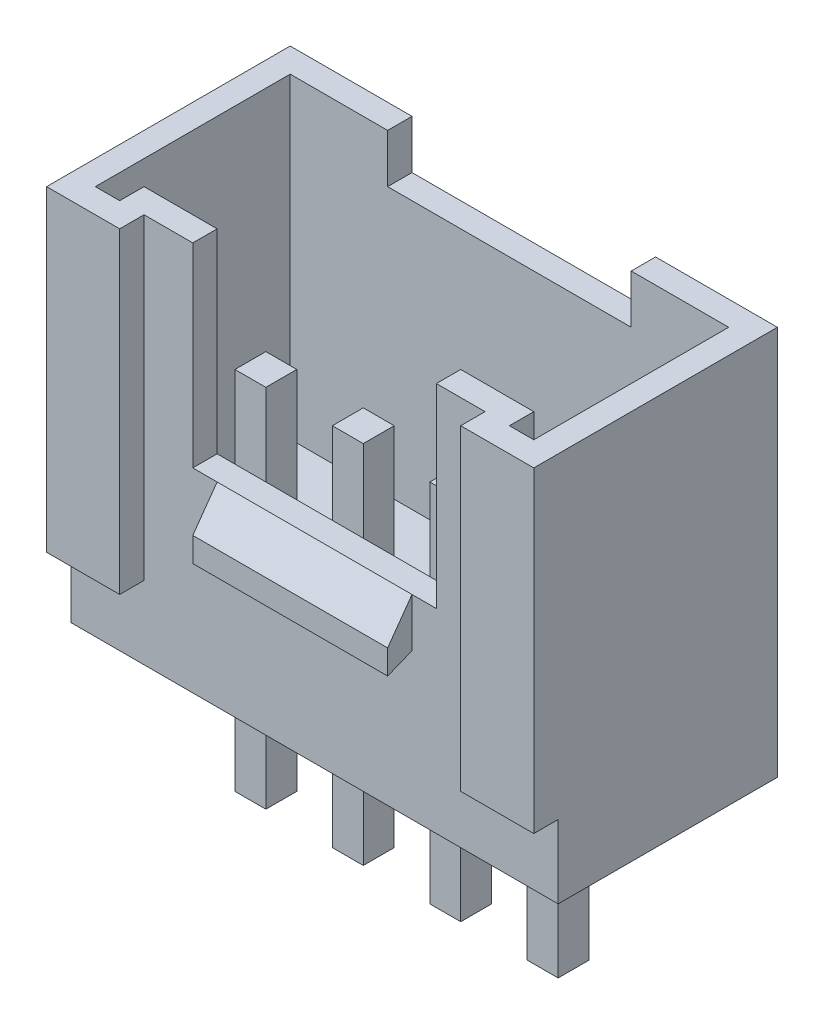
ISO-10303-21;
HEADER;
FILE_DESCRIPTION(('STEP AP214'),'2;1');
FILE_NAME('part.step','',(''),(''),'','','');
FILE_SCHEMA(('AUTOMOTIVE_DESIGN { 1 0 10303 214 1 1 1 1 }'));
ENDSEC;
DATA;
#1=APPLICATION_CONTEXT('core data for automotive mechanical design processes');
#2=APPLICATION_PROTOCOL_DEFINITION('international standard','automotive_design',2000,#1);
#3=PRODUCT_CONTEXT('',#1,'mechanical');
#4=PRODUCT('Part','Part','',(#3));
#5=PRODUCT_RELATED_PRODUCT_CATEGORY('part','',(#4));
#6=PRODUCT_DEFINITION_FORMATION('','',#4);
#7=PRODUCT_DEFINITION_CONTEXT('part definition',#1,'design');
#8=PRODUCT_DEFINITION('design','',#6,#7);
#9=PRODUCT_DEFINITION_SHAPE('','',#8);
#10=(LENGTH_UNIT() NAMED_UNIT(*) SI_UNIT(.MILLI.,.METRE.));
#11=(NAMED_UNIT(*) PLANE_ANGLE_UNIT() SI_UNIT($,.RADIAN.));
#12=(NAMED_UNIT(*) SI_UNIT($,.STERADIAN.) SOLID_ANGLE_UNIT());
#13=UNCERTAINTY_MEASURE_WITH_UNIT(LENGTH_MEASURE(1.E-05),#10,'distance_accuracy_value','');
#14=(GEOMETRIC_REPRESENTATION_CONTEXT(3) GLOBAL_UNCERTAINTY_ASSIGNED_CONTEXT((#13)) GLOBAL_UNIT_ASSIGNED_CONTEXT((#10,
#11,#12)) REPRESENTATION_CONTEXT('',''));
#15=CARTESIAN_POINT('',(0.,0.,0.));
#16=DIRECTION('',(0.,0.,1.));
#17=DIRECTION('',(1.,0.,0.));
#18=AXIS2_PLACEMENT_3D('',#15,#16,#17);
#19=CARTESIAN_POINT('',(0.,8.,0.));
#20=DIRECTION('',(0.,-1.,0.));
#21=DIRECTION('',(0.,0.,-1.));
#22=AXIS2_PLACEMENT_3D('',#19,#20,#21);
#23=PLANE('',#22);
#24=DIRECTION('',(-1.,0.,0.));
#25=VECTOR('',#24,1.);
#26=CARTESIAN_POINT('',(0.5,8.,-4.5));
#27=LINE('',#26,#25);
#28=CARTESIAN_POINT('',(2.5,8.,-4.5));
#29=VERTEX_POINT('',#28);
#30=CARTESIAN_POINT('',(0.5,8.,-4.5));
#31=VERTEX_POINT('',#30);
#32=EDGE_CURVE('E434',#29,#31,#27,.T.);
#33=ORIENTED_EDGE('',*,*,#32,.F.);
#34=DIRECTION('',(0.,0.,-1.));
#35=VECTOR('',#34,1.);
#36=CARTESIAN_POINT('',(2.5,8.,0.00100000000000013));
#37=LINE('',#36,#35);
#38=CARTESIAN_POINT('',(2.5,8.,-5.));
#39=VERTEX_POINT('',#38);
#40=EDGE_CURVE('E781',#29,#39,#37,.T.);
#41=ORIENTED_EDGE('',*,*,#40,.T.);
#42=DIRECTION('',(-1.,0.,0.));
#43=VECTOR('',#42,1.);
#44=CARTESIAN_POINT('',(0.,8.,-5.));
#45=LINE('',#44,#43);
#46=CARTESIAN_POINT('',(0.,8.,-5.));
#47=VERTEX_POINT('',#46);
#48=EDGE_CURVE('E871',#39,#47,#45,.T.);
#49=ORIENTED_EDGE('',*,*,#48,.T.);
#50=DIRECTION('',(0.,0.,1.));
#51=VECTOR('',#50,1.);
#52=CARTESIAN_POINT('',(0.,8.,0.));
#53=LINE('',#52,#51);
#54=CARTESIAN_POINT('',(0.,8.,0.));
#55=VERTEX_POINT('',#54);
#56=EDGE_CURVE('E853',#47,#55,#53,.T.);
#57=ORIENTED_EDGE('',*,*,#56,.T.);
#58=DIRECTION('',(1.,0.,0.));
#59=VECTOR('',#58,1.);
#60=CARTESIAN_POINT('',(0.,8.,0.));
#61=LINE('',#60,#59);
#62=CARTESIAN_POINT('',(1.5,8.,0.));
#63=VERTEX_POINT('',#62);
#64=EDGE_CURVE('E856',#55,#63,#61,.T.);
#65=ORIENTED_EDGE('',*,*,#64,.T.);
#66=DIRECTION('',(0.,0.,-1.));
#67=VECTOR('',#66,1.);
#68=CARTESIAN_POINT('',(1.5,8.,0.));
#69=LINE('',#68,#67);
#70=CARTESIAN_POINT('',(1.5,8.,-0.5));
#71=VERTEX_POINT('',#70);
#72=EDGE_CURVE('E859',#63,#71,#69,.T.);
#73=ORIENTED_EDGE('',*,*,#72,.T.);
#74=DIRECTION('',(1.,0.,0.));
#75=VECTOR('',#74,1.);
#76=CARTESIAN_POINT('',(1.5,8.,-0.5));
#77=LINE('',#76,#75);
#78=CARTESIAN_POINT('',(2.5,8.,-0.5));
#79=VERTEX_POINT('',#78);
#80=EDGE_CURVE('E862',#71,#79,#77,.T.);
#81=ORIENTED_EDGE('',*,*,#80,.T.);
#82=DIRECTION('',(0.,0.,1.));
#83=VECTOR('',#82,1.);
#84=CARTESIAN_POINT('',(2.5,8.,-7.40312423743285));
#85=LINE('',#84,#83);
#86=CARTESIAN_POINT('',(2.5,8.,-1.));
#87=VERTEX_POINT('',#86);
#88=EDGE_CURVE('E807',#87,#79,#85,.T.);
#89=ORIENTED_EDGE('',*,*,#88,.F.);
#90=DIRECTION('',(1.,0.,0.));
#91=VECTOR('',#90,1.);
#92=CARTESIAN_POINT('',(1.,8.,-1.));
#93=LINE('',#92,#91);
#94=CARTESIAN_POINT('',(1.,8.,-1.));
#95=VERTEX_POINT('',#94);
#96=EDGE_CURVE('E825',#95,#87,#93,.T.);
#97=ORIENTED_EDGE('',*,*,#96,.F.);
#98=DIRECTION('',(0.,0.,-1.));
#99=VECTOR('',#98,1.);
#100=CARTESIAN_POINT('',(1.,8.,-1.));
#101=LINE('',#100,#99);
#102=CARTESIAN_POINT('',(1.,8.,-0.499999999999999));
#103=VERTEX_POINT('',#102);
#104=EDGE_CURVE('E822',#103,#95,#101,.T.);
#105=ORIENTED_EDGE('',*,*,#104,.F.);
#106=DIRECTION('',(1.,0.,0.));
#107=VECTOR('',#106,1.);
#108=CARTESIAN_POINT('',(0.500000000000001,8.,-0.499999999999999));
#109=LINE('',#108,#107);
#110=CARTESIAN_POINT('',(0.500000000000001,8.,-0.499999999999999));
#111=VERTEX_POINT('',#110);
#112=EDGE_CURVE('E820',#111,#103,#109,.T.);
#113=ORIENTED_EDGE('',*,*,#112,.F.);
#114=DIRECTION('',(0.,0.,1.));
#115=VECTOR('',#114,1.);
#116=CARTESIAN_POINT('',(0.5,8.,-4.5));
#117=LINE('',#116,#115);
#118=EDGE_CURVE('E818',#31,#111,#117,.T.);
#119=ORIENTED_EDGE('',*,*,#118,.F.);
#120=EDGE_LOOP('',(#33,#41,#49,#57,#65,#73,#81,#89,#97,#105,#113,#119));
#121=FACE_BOUND('',#120,.T.);
#122=ADVANCED_FACE('F35',(#121),#23,.F.);
#123=CARTESIAN_POINT('',(10.,8.,-5.));
#124=VERTEX_POINT('',#123);
#125=CARTESIAN_POINT('',(7.5,8.,-5.));
#126=VERTEX_POINT('',#125);
#127=EDGE_CURVE('E872',#124,#126,#45,.T.);
#128=ORIENTED_EDGE('',*,*,#127,.T.);
#129=DIRECTION('',(0.,0.,-1.));
#130=VECTOR('',#129,1.);
#131=CARTESIAN_POINT('',(7.5,8.,0.00100000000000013));
#132=LINE('',#131,#130);
#133=CARTESIAN_POINT('',(7.5,8.,-4.5));
#134=VERTEX_POINT('',#133);
#135=EDGE_CURVE('E787',#134,#126,#132,.T.);
#136=ORIENTED_EDGE('',*,*,#135,.F.);
#137=CARTESIAN_POINT('',(9.5,8.,-4.5));
#138=VERTEX_POINT('',#137);
#139=EDGE_CURVE('E438',#138,#134,#27,.T.);
#140=ORIENTED_EDGE('',*,*,#139,.F.);
#141=DIRECTION('',(0.,0.,-1.));
#142=VECTOR('',#141,1.);
#143=CARTESIAN_POINT('',(9.5,8.,-1.52884615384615));
#144=LINE('',#143,#142);
#145=CARTESIAN_POINT('',(9.5,8.,-0.5));
#146=VERTEX_POINT('',#145);
#147=EDGE_CURVE('E832',#146,#138,#144,.T.);
#148=ORIENTED_EDGE('',*,*,#147,.F.);
#149=DIRECTION('',(1.,0.,0.));
#150=VECTOR('',#149,1.);
#151=CARTESIAN_POINT('',(9.5,8.,-0.5));
#152=LINE('',#151,#150);
#153=CARTESIAN_POINT('',(9.,8.,-0.5));
#154=VERTEX_POINT('',#153);
#155=EDGE_CURVE('E830',#154,#146,#152,.T.);
#156=ORIENTED_EDGE('',*,*,#155,.F.);
#157=DIRECTION('',(0.,0.,1.));
#158=VECTOR('',#157,1.);
#159=CARTESIAN_POINT('',(9.,8.,-1.));
#160=LINE('',#159,#158);
#161=CARTESIAN_POINT('',(9.,8.,-1.));
#162=VERTEX_POINT('',#161);
#163=EDGE_CURVE('E828',#162,#154,#160,.T.);
#164=ORIENTED_EDGE('',*,*,#163,.F.);
#165=CARTESIAN_POINT('',(7.5,8.,-1.));
#166=VERTEX_POINT('',#165);
#167=EDGE_CURVE('E824',#166,#162,#93,.T.);
#168=ORIENTED_EDGE('',*,*,#167,.F.);
#169=DIRECTION('',(0.,0.,1.));
#170=VECTOR('',#169,1.);
#171=CARTESIAN_POINT('',(7.5,8.,-7.40312423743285));
#172=LINE('',#171,#170);
#173=CARTESIAN_POINT('',(7.5,8.,-0.5));
#174=VERTEX_POINT('',#173);
#175=EDGE_CURVE('E811',#166,#174,#172,.T.);
#176=ORIENTED_EDGE('',*,*,#175,.T.);
#177=CARTESIAN_POINT('',(8.5,8.,-0.5));
#178=VERTEX_POINT('',#177);
#179=EDGE_CURVE('E861',#174,#178,#77,.T.);
#180=ORIENTED_EDGE('',*,*,#179,.T.);
#181=DIRECTION('',(0.,0.,1.));
#182=VECTOR('',#181,1.);
#183=CARTESIAN_POINT('',(8.5,8.,0.));
#184=LINE('',#183,#182);
#185=CARTESIAN_POINT('',(8.5,8.,0.));
#186=VERTEX_POINT('',#185);
#187=EDGE_CURVE('E865',#178,#186,#184,.T.);
#188=ORIENTED_EDGE('',*,*,#187,.T.);
#189=DIRECTION('',(1.,0.,0.));
#190=VECTOR('',#189,1.);
#191=CARTESIAN_POINT('',(8.5,8.,0.));
#192=LINE('',#191,#190);
#193=CARTESIAN_POINT('',(10.,8.,0.));
#194=VERTEX_POINT('',#193);
#195=EDGE_CURVE('E867',#186,#194,#192,.T.);
#196=ORIENTED_EDGE('',*,*,#195,.T.);
#197=DIRECTION('',(0.,0.,-1.));
#198=VECTOR('',#197,1.);
#199=CARTESIAN_POINT('',(10.,8.,0.));
#200=LINE('',#199,#198);
#201=EDGE_CURVE('E869',#194,#124,#200,.T.);
#202=ORIENTED_EDGE('',*,*,#201,.T.);
#203=EDGE_LOOP('',(#128,#136,#140,#148,#156,#164,#168,#176,#180,#188,#196,#202));
#204=FACE_BOUND('',#203,.T.);
#205=ADVANCED_FACE('F959',(#204),#23,.F.);
#206=CARTESIAN_POINT('',(0.,0.,0.));
#207=DIRECTION('',(0.,-1.,0.));
#208=DIRECTION('',(0.,0.,-1.));
#209=AXIS2_PLACEMENT_3D('',#206,#207,#208);
#210=PLANE('',#209);
#211=DIRECTION('',(0.,0.,-1.));
#212=VECTOR('',#211,1.);
#213=CARTESIAN_POINT('',(10.,0.,0.));
#214=LINE('',#213,#212);
#215=CARTESIAN_POINT('',(10.,0.,-0.5));
#216=VERTEX_POINT('',#215);
#217=CARTESIAN_POINT('',(10.,0.,-5.));
#218=VERTEX_POINT('',#217);
#219=EDGE_CURVE('E880',#216,#218,#214,.T.);
#220=ORIENTED_EDGE('',*,*,#219,.F.);
#221=DIRECTION('',(1.,0.,0.));
#222=VECTOR('',#221,1.);
#223=CARTESIAN_POINT('',(1.5,0.,-0.5));
#224=LINE('',#223,#222);
#225=CARTESIAN_POINT('',(0.,0.,-0.5));
#226=VERTEX_POINT('',#225);
#227=EDGE_CURVE('E878',#226,#216,#224,.T.);
#228=ORIENTED_EDGE('',*,*,#227,.F.);
#229=DIRECTION('',(0.,0.,1.));
#230=VECTOR('',#229,1.);
#231=CARTESIAN_POINT('',(0.,0.,0.));
#232=LINE('',#231,#230);
#233=CARTESIAN_POINT('',(0.,0.,-5.));
#234=VERTEX_POINT('',#233);
#235=EDGE_CURVE('E852',#234,#226,#232,.T.);
#236=ORIENTED_EDGE('',*,*,#235,.F.);
#237=DIRECTION('',(-1.,0.,0.));
#238=VECTOR('',#237,1.);
#239=CARTESIAN_POINT('',(0.,0.,-5.));
#240=LINE('',#239,#238);
#241=EDGE_CURVE('E857',#218,#234,#240,.T.);
#242=ORIENTED_EDGE('',*,*,#241,.F.);
#243=EDGE_LOOP('',(#220,#228,#236,#242));
#244=FACE_BOUND('',#243,.T.);
#245=DIRECTION('',(1.,0.,0.));
#246=VECTOR('',#245,1.);
#247=CARTESIAN_POINT('',(0.,0.,-2.8175));
#248=LINE('',#247,#246);
#249=CARTESIAN_POINT('',(7.6825,0.,-2.8175));
#250=VERTEX_POINT('',#249);
#251=CARTESIAN_POINT('',(8.3175,0.,-2.8175));
#252=VERTEX_POINT('',#251);
#253=EDGE_CURVE('E606',#250,#252,#248,.T.);
#254=ORIENTED_EDGE('',*,*,#253,.F.);
#255=DIRECTION('',(0.,0.,-1.));
#256=VECTOR('',#255,1.);
#257=CARTESIAN_POINT('',(7.6825,0.,0.));
#258=LINE('',#257,#256);
#259=CARTESIAN_POINT('',(7.6825,0.,-2.1825));
#260=VERTEX_POINT('',#259);
#261=EDGE_CURVE('E585',#260,#250,#258,.T.);
#262=ORIENTED_EDGE('',*,*,#261,.F.);
#263=DIRECTION('',(-1.,0.,0.));
#264=VECTOR('',#263,1.);
#265=CARTESIAN_POINT('',(0.,0.,-2.1825));
#266=LINE('',#265,#264);
#267=CARTESIAN_POINT('',(8.3175,0.,-2.1825));
#268=VERTEX_POINT('',#267);
#269=EDGE_CURVE('E600',#268,#260,#266,.T.);
#270=ORIENTED_EDGE('',*,*,#269,.F.);
#271=DIRECTION('',(0.,0.,1.));
#272=VECTOR('',#271,1.);
#273=CARTESIAN_POINT('',(8.3175,0.,0.));
#274=LINE('',#273,#272);
#275=EDGE_CURVE('E603',#252,#268,#274,.T.);
#276=ORIENTED_EDGE('',*,*,#275,.F.);
#277=EDGE_LOOP('',(#254,#262,#270,#276));
#278=FACE_BOUND('',#277,.T.);
#279=DIRECTION('',(1.,0.,0.));
#280=VECTOR('',#279,1.);
#281=CARTESIAN_POINT('',(0.,0.,-2.8175));
#282=LINE('',#281,#280);
#283=CARTESIAN_POINT('',(5.6825,0.,-2.8175));
#284=VERTEX_POINT('',#283);
#285=CARTESIAN_POINT('',(6.3175,0.,-2.8175));
#286=VERTEX_POINT('',#285);
#287=EDGE_CURVE('E658',#284,#286,#282,.T.);
#288=ORIENTED_EDGE('',*,*,#287,.F.);
#289=DIRECTION('',(0.,0.,-1.));
#290=VECTOR('',#289,1.);
#291=CARTESIAN_POINT('',(5.6825,0.,0.));
#292=LINE('',#291,#290);
#293=CARTESIAN_POINT('',(5.6825,0.,-2.1825));
#294=VERTEX_POINT('',#293);
#295=EDGE_CURVE('E637',#294,#284,#292,.T.);
#296=ORIENTED_EDGE('',*,*,#295,.F.);
#297=DIRECTION('',(-1.,0.,0.));
#298=VECTOR('',#297,1.);
#299=CARTESIAN_POINT('',(0.,0.,-2.1825));
#300=LINE('',#299,#298);
#301=CARTESIAN_POINT('',(6.3175,0.,-2.1825));
#302=VERTEX_POINT('',#301);
#303=EDGE_CURVE('E652',#302,#294,#300,.T.);
#304=ORIENTED_EDGE('',*,*,#303,.F.);
#305=DIRECTION('',(0.,0.,1.));
#306=VECTOR('',#305,1.);
#307=CARTESIAN_POINT('',(6.3175,0.,0.));
#308=LINE('',#307,#306);
#309=EDGE_CURVE('E655',#286,#302,#308,.T.);
#310=ORIENTED_EDGE('',*,*,#309,.F.);
#311=EDGE_LOOP('',(#288,#296,#304,#310));
#312=FACE_BOUND('',#311,.T.);
#313=DIRECTION('',(1.,0.,0.));
#314=VECTOR('',#313,1.);
#315=CARTESIAN_POINT('',(0.,0.,-2.8175));
#316=LINE('',#315,#314);
#317=CARTESIAN_POINT('',(3.6825,0.,-2.8175));
#318=VERTEX_POINT('',#317);
#319=CARTESIAN_POINT('',(4.3175,0.,-2.8175));
#320=VERTEX_POINT('',#319);
#321=EDGE_CURVE('E710',#318,#320,#316,.T.);
#322=ORIENTED_EDGE('',*,*,#321,.F.);
#323=DIRECTION('',(0.,0.,-1.));
#324=VECTOR('',#323,1.);
#325=CARTESIAN_POINT('',(3.6825,0.,0.));
#326=LINE('',#325,#324);
#327=CARTESIAN_POINT('',(3.6825,0.,-2.1825));
#328=VERTEX_POINT('',#327);
#329=EDGE_CURVE('E689',#328,#318,#326,.T.);
#330=ORIENTED_EDGE('',*,*,#329,.F.);
#331=DIRECTION('',(-1.,0.,0.));
#332=VECTOR('',#331,1.);
#333=CARTESIAN_POINT('',(0.,0.,-2.1825));
#334=LINE('',#333,#332);
#335=CARTESIAN_POINT('',(4.3175,0.,-2.1825));
#336=VERTEX_POINT('',#335);
#337=EDGE_CURVE('E704',#336,#328,#334,.T.);
#338=ORIENTED_EDGE('',*,*,#337,.F.);
#339=DIRECTION('',(0.,0.,1.));
#340=VECTOR('',#339,1.);
#341=CARTESIAN_POINT('',(4.3175,0.,0.));
#342=LINE('',#341,#340);
#343=EDGE_CURVE('E707',#320,#336,#342,.T.);
#344=ORIENTED_EDGE('',*,*,#343,.F.);
#345=EDGE_LOOP('',(#322,#330,#338,#344));
#346=FACE_BOUND('',#345,.T.);
#347=DIRECTION('',(0.,0.,-1.));
#348=VECTOR('',#347,1.);
#349=CARTESIAN_POINT('',(1.6825,0.,0.));
#350=LINE('',#349,#348);
#351=CARTESIAN_POINT('',(1.6825,0.,-2.1825));
#352=VERTEX_POINT('',#351);
#353=CARTESIAN_POINT('',(1.6825,0.,-2.8175));
#354=VERTEX_POINT('',#353);
#355=EDGE_CURVE('E762',#352,#354,#350,.T.);
#356=ORIENTED_EDGE('',*,*,#355,.F.);
#357=DIRECTION('',(-1.,0.,0.));
#358=VECTOR('',#357,1.);
#359=CARTESIAN_POINT('',(0.,0.,-2.1825));
#360=LINE('',#359,#358);
#361=CARTESIAN_POINT('',(2.3175,0.,-2.1825));
#362=VERTEX_POINT('',#361);
#363=EDGE_CURVE('E741',#362,#352,#360,.T.);
#364=ORIENTED_EDGE('',*,*,#363,.F.);
#365=DIRECTION('',(0.,0.,1.));
#366=VECTOR('',#365,1.);
#367=CARTESIAN_POINT('',(2.3175,0.,0.));
#368=LINE('',#367,#366);
#369=CARTESIAN_POINT('',(2.3175,0.,-2.8175));
#370=VERTEX_POINT('',#369);
#371=EDGE_CURVE('E756',#370,#362,#368,.T.);
#372=ORIENTED_EDGE('',*,*,#371,.F.);
#373=DIRECTION('',(1.,0.,0.));
#374=VECTOR('',#373,1.);
#375=CARTESIAN_POINT('',(0.,0.,-2.8175));
#376=LINE('',#375,#374);
#377=EDGE_CURVE('E759',#354,#370,#376,.T.);
#378=ORIENTED_EDGE('',*,*,#377,.F.);
#379=EDGE_LOOP('',(#356,#364,#372,#378));
#380=FACE_BOUND('',#379,.T.);
#381=ADVANCED_FACE('F934',(#244,#278,#312,#346,#380),#210,.T.);
#382=CARTESIAN_POINT('',(0.,8.,0.));
#383=DIRECTION('',(1.,0.,0.));
#384=DIRECTION('',(0.,0.,-1.));
#385=AXIS2_PLACEMENT_3D('',#382,#383,#384);
#386=PLANE('',#385);
#387=DIRECTION('',(0.,1.,0.));
#388=VECTOR('',#387,1.);
#389=CARTESIAN_POINT('',(0.,0.,-0.5));
#390=LINE('',#389,#388);
#391=CARTESIAN_POINT('',(0.,1.5,-0.5));
#392=VERTEX_POINT('',#391);
#393=EDGE_CURVE('E506',#226,#392,#390,.T.);
#394=ORIENTED_EDGE('',*,*,#393,.T.);
#395=DIRECTION('',(0.,0.,1.));
#396=VECTOR('',#395,1.);
#397=CARTESIAN_POINT('',(0.,1.5,0.));
#398=LINE('',#397,#396);
#399=CARTESIAN_POINT('',(0.,1.5,0.));
#400=VERTEX_POINT('',#399);
#401=EDGE_CURVE('E509',#392,#400,#398,.T.);
#402=ORIENTED_EDGE('',*,*,#401,.T.);
#403=DIRECTION('',(0.,-1.,0.));
#404=VECTOR('',#403,1.);
#405=CARTESIAN_POINT('',(0.,8.,0.));
#406=LINE('',#405,#404);
#407=EDGE_CURVE('E43',#55,#400,#406,.T.);
#408=ORIENTED_EDGE('',*,*,#407,.F.);
#409=ORIENTED_EDGE('',*,*,#56,.F.);
#410=DIRECTION('',(0.,-1.,0.));
#411=VECTOR('',#410,1.);
#412=CARTESIAN_POINT('',(0.,8.,-5.));
#413=LINE('',#412,#411);
#414=EDGE_CURVE('E875',#47,#234,#413,.T.);
#415=ORIENTED_EDGE('',*,*,#414,.T.);
#416=ORIENTED_EDGE('',*,*,#235,.T.);
#417=EDGE_LOOP('',(#394,#402,#408,#409,#415,#416));
#418=FACE_BOUND('',#417,.T.);
#419=ADVANCED_FACE('F37',(#418),#386,.F.);
#420=CARTESIAN_POINT('',(0.,8.,0.));
#421=DIRECTION('',(0.,0.,-1.));
#422=DIRECTION('',(-1.,0.,0.));
#423=AXIS2_PLACEMENT_3D('',#420,#421,#422);
#424=PLANE('',#423);
#425=ORIENTED_EDGE('',*,*,#407,.T.);
#426=DIRECTION('',(1.,0.,0.));
#427=VECTOR('',#426,1.);
#428=CARTESIAN_POINT('',(0.,1.5,0.));
#429=LINE('',#428,#427);
#430=CARTESIAN_POINT('',(1.5,1.5,0.));
#431=VERTEX_POINT('',#430);
#432=EDGE_CURVE('E513',#400,#431,#429,.T.);
#433=ORIENTED_EDGE('',*,*,#432,.T.);
#434=DIRECTION('',(0.,-1.,0.));
#435=VECTOR('',#434,1.);
#436=CARTESIAN_POINT('',(1.5,8.,0.));
#437=LINE('',#436,#435);
#438=EDGE_CURVE('E900',#63,#431,#437,.T.);
#439=ORIENTED_EDGE('',*,*,#438,.F.);
#440=ORIENTED_EDGE('',*,*,#64,.F.);
#441=EDGE_LOOP('',(#425,#433,#439,#440));
#442=FACE_BOUND('',#441,.T.);
#443=ADVANCED_FACE('F905',(#442),#424,.F.);
#444=CARTESIAN_POINT('',(1.5,8.,0.));
#445=DIRECTION('',(-1.,0.,0.));
#446=DIRECTION('',(0.,0.,1.));
#447=AXIS2_PLACEMENT_3D('',#444,#445,#446);
#448=PLANE('',#447);
#449=ORIENTED_EDGE('',*,*,#438,.T.);
#450=DIRECTION('',(0.,0.,-1.));
#451=VECTOR('',#450,1.);
#452=CARTESIAN_POINT('',(1.5,1.5,0.));
#453=LINE('',#452,#451);
#454=CARTESIAN_POINT('',(1.5,1.5,-0.5));
#455=VERTEX_POINT('',#454);
#456=EDGE_CURVE('E522',#431,#455,#453,.T.);
#457=ORIENTED_EDGE('',*,*,#456,.T.);
#458=DIRECTION('',(0.,-1.,0.));
#459=VECTOR('',#458,1.);
#460=CARTESIAN_POINT('',(1.5,8.,-0.5));
#461=LINE('',#460,#459);
#462=EDGE_CURVE('E897',#71,#455,#461,.T.);
#463=ORIENTED_EDGE('',*,*,#462,.F.);
#464=ORIENTED_EDGE('',*,*,#72,.F.);
#465=EDGE_LOOP('',(#449,#457,#463,#464));
#466=FACE_BOUND('',#465,.T.);
#467=ADVANCED_FACE('F915',(#466),#448,.F.);
#468=CARTESIAN_POINT('',(1.5,8.,-0.5));
#469=DIRECTION('',(0.,0.,-1.));
#470=DIRECTION('',(-1.,0.,0.));
#471=AXIS2_PLACEMENT_3D('',#468,#469,#470);
#472=PLANE('',#471);
#473=ORIENTED_EDGE('',*,*,#227,.T.);
#474=DIRECTION('',(0.,1.,0.));
#475=VECTOR('',#474,1.);
#476=CARTESIAN_POINT('',(10.,0.,-0.499999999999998));
#477=LINE('',#476,#475);
#478=CARTESIAN_POINT('',(10.,1.5,-0.499999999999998));
#479=VERTEX_POINT('',#478);
#480=EDGE_CURVE('E501',#216,#479,#477,.T.);
#481=ORIENTED_EDGE('',*,*,#480,.T.);
#482=DIRECTION('',(1.,0.,0.));
#483=VECTOR('',#482,1.);
#484=CARTESIAN_POINT('',(0.,1.5,-0.5));
#485=LINE('',#484,#483);
#486=CARTESIAN_POINT('',(8.5,1.5,-0.499999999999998));
#487=VERTEX_POINT('',#486);
#488=EDGE_CURVE('E512',#487,#479,#485,.T.);
#489=ORIENTED_EDGE('',*,*,#488,.F.);
#490=DIRECTION('',(0.,-1.,0.));
#491=VECTOR('',#490,1.);
#492=CARTESIAN_POINT('',(8.5,8.,-0.5));
#493=LINE('',#492,#491);
#494=EDGE_CURVE('E894',#178,#487,#493,.T.);
#495=ORIENTED_EDGE('',*,*,#494,.F.);
#496=ORIENTED_EDGE('',*,*,#179,.F.);
#497=DIRECTION('',(0.,1.,0.));
#498=VECTOR('',#497,1.);
#499=CARTESIAN_POINT('',(7.5,8.,-0.5));
#500=LINE('',#499,#498);
#501=CARTESIAN_POINT('',(7.5,4.,-0.5));
#502=VERTEX_POINT('',#501);
#503=EDGE_CURVE('E791',#502,#174,#500,.T.);
#504=ORIENTED_EDGE('',*,*,#503,.F.);
#505=DIRECTION('',(1.,0.,0.));
#506=VECTOR('',#505,1.);
#507=CARTESIAN_POINT('',(2.5,4.,-0.5));
#508=LINE('',#507,#506);
#509=CARTESIAN_POINT('',(7.,4.,-0.5));
#510=VERTEX_POINT('',#509);
#511=EDGE_CURVE('E797',#510,#502,#508,.T.);
#512=ORIENTED_EDGE('',*,*,#511,.F.);
#513=DIRECTION('',(0.,1.,0.));
#514=VECTOR('',#513,1.);
#515=CARTESIAN_POINT('',(7.,4.,-0.5));
#516=LINE('',#515,#514);
#517=CARTESIAN_POINT('',(7.,3.,-0.5));
#518=VERTEX_POINT('',#517);
#519=EDGE_CURVE('E534',#518,#510,#516,.T.);
#520=ORIENTED_EDGE('',*,*,#519,.F.);
#521=DIRECTION('',(1.,0.,0.));
#522=VECTOR('',#521,1.);
#523=CARTESIAN_POINT('',(3.,3.,-0.500000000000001));
#524=LINE('',#523,#522);
#525=CARTESIAN_POINT('',(3.,3.,-0.500000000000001));
#526=VERTEX_POINT('',#525);
#527=EDGE_CURVE('E553',#526,#518,#524,.T.);
#528=ORIENTED_EDGE('',*,*,#527,.F.);
#529=DIRECTION('',(0.,1.,0.));
#530=VECTOR('',#529,1.);
#531=CARTESIAN_POINT('',(3.,4.,-0.500000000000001));
#532=LINE('',#531,#530);
#533=CARTESIAN_POINT('',(3.,4.,-0.500000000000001));
#534=VERTEX_POINT('',#533);
#535=EDGE_CURVE('E545',#526,#534,#532,.T.);
#536=ORIENTED_EDGE('',*,*,#535,.T.);
#537=CARTESIAN_POINT('',(2.5,4.,-0.5));
#538=VERTEX_POINT('',#537);
#539=EDGE_CURVE('E794',#538,#534,#508,.T.);
#540=ORIENTED_EDGE('',*,*,#539,.F.);
#541=DIRECTION('',(0.,-1.,0.));
#542=VECTOR('',#541,1.);
#543=CARTESIAN_POINT('',(2.5,8.,-0.5));
#544=LINE('',#543,#542);
#545=EDGE_CURVE('E784',#79,#538,#544,.T.);
#546=ORIENTED_EDGE('',*,*,#545,.F.);
#547=ORIENTED_EDGE('',*,*,#80,.F.);
#548=ORIENTED_EDGE('',*,*,#462,.T.);
#549=EDGE_CURVE('E519',#392,#455,#485,.T.);
#550=ORIENTED_EDGE('',*,*,#549,.F.);
#551=ORIENTED_EDGE('',*,*,#393,.F.);
#552=EDGE_LOOP('',(#473,#481,#489,#495,#496,#504,#512,#520,#528,#536,#540,#546,#547,#548,#550,#551));
#553=FACE_BOUND('',#552,.T.);
#554=ADVANCED_FACE('F919',(#553),#472,.F.);
#555=CARTESIAN_POINT('',(8.5,8.,0.));
#556=DIRECTION('',(1.,0.,0.));
#557=DIRECTION('',(0.,0.,-1.));
#558=AXIS2_PLACEMENT_3D('',#555,#556,#557);
#559=PLANE('',#558);
#560=ORIENTED_EDGE('',*,*,#494,.T.);
#561=DIRECTION('',(0.,0.,1.));
#562=VECTOR('',#561,1.);
#563=CARTESIAN_POINT('',(8.5,1.5,0.));
#564=LINE('',#563,#562);
#565=CARTESIAN_POINT('',(8.5,1.5,0.));
#566=VERTEX_POINT('',#565);
#567=EDGE_CURVE('E516',#487,#566,#564,.T.);
#568=ORIENTED_EDGE('',*,*,#567,.T.);
#569=DIRECTION('',(0.,-1.,0.));
#570=VECTOR('',#569,1.);
#571=CARTESIAN_POINT('',(8.5,8.,0.));
#572=LINE('',#571,#570);
#573=EDGE_CURVE('E891',#186,#566,#572,.T.);
#574=ORIENTED_EDGE('',*,*,#573,.F.);
#575=ORIENTED_EDGE('',*,*,#187,.F.);
#576=EDGE_LOOP('',(#560,#568,#574,#575));
#577=FACE_BOUND('',#576,.T.);
#578=ADVANCED_FACE('F953',(#577),#559,.F.);
#579=CARTESIAN_POINT('',(8.5,8.,0.));
#580=DIRECTION('',(0.,0.,-1.));
#581=DIRECTION('',(-1.,0.,0.));
#582=AXIS2_PLACEMENT_3D('',#579,#580,#581);
#583=PLANE('',#582);
#584=ORIENTED_EDGE('',*,*,#573,.T.);
#585=CARTESIAN_POINT('',(10.,1.5,0.));
#586=VERTEX_POINT('',#585);
#587=EDGE_CURVE('E517',#566,#586,#429,.T.);
#588=ORIENTED_EDGE('',*,*,#587,.T.);
#589=DIRECTION('',(0.,-1.,0.));
#590=VECTOR('',#589,1.);
#591=CARTESIAN_POINT('',(10.,8.,0.));
#592=LINE('',#591,#590);
#593=EDGE_CURVE('E888',#194,#586,#592,.T.);
#594=ORIENTED_EDGE('',*,*,#593,.F.);
#595=ORIENTED_EDGE('',*,*,#195,.F.);
#596=EDGE_LOOP('',(#584,#588,#594,#595));
#597=FACE_BOUND('',#596,.T.);
#598=ADVANCED_FACE('F948',(#597),#583,.F.);
#599=CARTESIAN_POINT('',(10.,8.,0.));
#600=DIRECTION('',(-1.,0.,0.));
#601=DIRECTION('',(0.,0.,1.));
#602=AXIS2_PLACEMENT_3D('',#599,#600,#601);
#603=PLANE('',#602);
#604=ORIENTED_EDGE('',*,*,#593,.T.);
#605=DIRECTION('',(0.,0.,1.));
#606=VECTOR('',#605,1.);
#607=CARTESIAN_POINT('',(10.,1.5,0.));
#608=LINE('',#607,#606);
#609=EDGE_CURVE('E504',#479,#586,#608,.T.);
#610=ORIENTED_EDGE('',*,*,#609,.F.);
#611=ORIENTED_EDGE('',*,*,#480,.F.);
#612=ORIENTED_EDGE('',*,*,#219,.T.);
#613=DIRECTION('',(0.,-1.,0.));
#614=VECTOR('',#613,1.);
#615=CARTESIAN_POINT('',(10.,8.,-5.));
#616=LINE('',#615,#614);
#617=EDGE_CURVE('E885',#124,#218,#616,.T.);
#618=ORIENTED_EDGE('',*,*,#617,.F.);
#619=ORIENTED_EDGE('',*,*,#201,.F.);
#620=EDGE_LOOP('',(#604,#610,#611,#612,#618,#619));
#621=FACE_BOUND('',#620,.T.);
#622=ADVANCED_FACE('F940',(#621),#603,.F.);
#623=CARTESIAN_POINT('',(0.,8.,-5.));
#624=DIRECTION('',(0.,0.,1.));
#625=DIRECTION('',(1.,0.,0.));
#626=AXIS2_PLACEMENT_3D('',#623,#624,#625);
#627=PLANE('',#626);
#628=ORIENTED_EDGE('',*,*,#48,.F.);
#629=DIRECTION('',(0.,1.,0.));
#630=VECTOR('',#629,1.);
#631=CARTESIAN_POINT('',(2.5,8.,-5.));
#632=LINE('',#631,#630);
#633=CARTESIAN_POINT('',(2.5,7.,-5.));
#634=VERTEX_POINT('',#633);
#635=EDGE_CURVE('E773',#634,#39,#632,.T.);
#636=ORIENTED_EDGE('',*,*,#635,.F.);
#637=DIRECTION('',(-1.,0.,0.));
#638=VECTOR('',#637,1.);
#639=CARTESIAN_POINT('',(2.5,7.,-5.));
#640=LINE('',#639,#638);
#641=CARTESIAN_POINT('',(7.5,7.,-5.));
#642=VERTEX_POINT('',#641);
#643=EDGE_CURVE('E778',#642,#634,#640,.T.);
#644=ORIENTED_EDGE('',*,*,#643,.F.);
#645=DIRECTION('',(0.,-1.,0.));
#646=VECTOR('',#645,1.);
#647=CARTESIAN_POINT('',(7.5,8.,-5.));
#648=LINE('',#647,#646);
#649=EDGE_CURVE('E775',#126,#642,#648,.T.);
#650=ORIENTED_EDGE('',*,*,#649,.F.);
#651=ORIENTED_EDGE('',*,*,#127,.F.);
#652=ORIENTED_EDGE('',*,*,#617,.T.);
#653=ORIENTED_EDGE('',*,*,#241,.T.);
#654=ORIENTED_EDGE('',*,*,#414,.F.);
#655=EDGE_LOOP('',(#628,#636,#644,#650,#651,#652,#653,#654));
#656=FACE_BOUND('',#655,.T.);
#657=ADVANCED_FACE('F929',(#656),#627,.F.);
#658=CARTESIAN_POINT('',(0.5,8.,-1.53846153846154));
#659=DIRECTION('',(1.,0.,0.));
#660=DIRECTION('',(0.,0.,-1.));
#661=AXIS2_PLACEMENT_3D('',#658,#659,#660);
#662=PLANE('',#661);
#663=DIRECTION('',(0.,0.,1.));
#664=VECTOR('',#663,1.);
#665=CARTESIAN_POINT('',(0.500000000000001,1.51,0.));
#666=LINE('',#665,#664);
#667=CARTESIAN_POINT('',(0.5,1.51,-4.5));
#668=VERTEX_POINT('',#667);
#669=CARTESIAN_POINT('',(0.500000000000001,1.51,-0.499999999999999));
#670=VERTEX_POINT('',#669);
#671=EDGE_CURVE('E441',#668,#670,#666,.T.);
#672=ORIENTED_EDGE('',*,*,#671,.F.);
#673=DIRECTION('',(0.,-1.,0.));
#674=VECTOR('',#673,1.);
#675=CARTESIAN_POINT('',(0.5,8.,-4.5));
#676=LINE('',#675,#674);
#677=EDGE_CURVE('E426',#31,#668,#676,.T.);
#678=ORIENTED_EDGE('',*,*,#677,.F.);
#679=ORIENTED_EDGE('',*,*,#118,.T.);
#680=DIRECTION('',(0.,-1.,0.));
#681=VECTOR('',#680,1.);
#682=CARTESIAN_POINT('',(0.500000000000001,8.,-0.499999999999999));
#683=LINE('',#682,#681);
#684=EDGE_CURVE('E443',#111,#670,#683,.T.);
#685=ORIENTED_EDGE('',*,*,#684,.T.);
#686=EDGE_LOOP('',(#672,#678,#679,#685));
#687=FACE_BOUND('',#686,.T.);
#688=ADVANCED_FACE('F442',(#687),#662,.T.);
#689=CARTESIAN_POINT('',(0.500000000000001,8.,-0.499999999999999));
#690=DIRECTION('',(0.,0.,-1.));
#691=DIRECTION('',(-1.,0.,0.));
#692=AXIS2_PLACEMENT_3D('',#689,#690,#691);
#693=PLANE('',#692);
#694=DIRECTION('',(1.,0.,0.));
#695=VECTOR('',#694,1.);
#696=CARTESIAN_POINT('',(0.,1.51,-0.499999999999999));
#697=LINE('',#696,#695);
#698=CARTESIAN_POINT('',(1.,1.51,-0.499999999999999));
#699=VERTEX_POINT('',#698);
#700=EDGE_CURVE('E50',#670,#699,#697,.T.);
#701=ORIENTED_EDGE('',*,*,#700,.F.);
#702=ORIENTED_EDGE('',*,*,#684,.F.);
#703=ORIENTED_EDGE('',*,*,#112,.T.);
#704=DIRECTION('',(0.,-1.,0.));
#705=VECTOR('',#704,1.);
#706=CARTESIAN_POINT('',(1.,8.,-0.499999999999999));
#707=LINE('',#706,#705);
#708=EDGE_CURVE('E849',#103,#699,#707,.T.);
#709=ORIENTED_EDGE('',*,*,#708,.T.);
#710=EDGE_LOOP('',(#701,#702,#703,#709));
#711=FACE_BOUND('',#710,.T.);
#712=ADVANCED_FACE('F1464',(#711),#693,.T.);
#713=CARTESIAN_POINT('',(1.,8.,-1.));
#714=DIRECTION('',(-1.,0.,0.));
#715=DIRECTION('',(0.,0.,1.));
#716=AXIS2_PLACEMENT_3D('',#713,#714,#715);
#717=PLANE('',#716);
#718=DIRECTION('',(0.,0.,1.));
#719=VECTOR('',#718,1.);
#720=CARTESIAN_POINT('',(1.,1.51,0.));
#721=LINE('',#720,#719);
#722=CARTESIAN_POINT('',(1.,1.51,-1.));
#723=VERTEX_POINT('',#722);
#724=EDGE_CURVE('E58',#723,#699,#721,.T.);
#725=ORIENTED_EDGE('',*,*,#724,.T.);
#726=ORIENTED_EDGE('',*,*,#708,.F.);
#727=ORIENTED_EDGE('',*,*,#104,.T.);
#728=DIRECTION('',(0.,-1.,0.));
#729=VECTOR('',#728,1.);
#730=CARTESIAN_POINT('',(1.,8.,-1.));
#731=LINE('',#730,#729);
#732=EDGE_CURVE('E847',#95,#723,#731,.T.);
#733=ORIENTED_EDGE('',*,*,#732,.T.);
#734=EDGE_LOOP('',(#725,#726,#727,#733));
#735=FACE_BOUND('',#734,.T.);
#736=ADVANCED_FACE('F1455',(#735),#717,.T.);
#737=CARTESIAN_POINT('',(1.,8.,-1.));
#738=DIRECTION('',(0.,0.,-1.));
#739=DIRECTION('',(-1.,0.,0.));
#740=AXIS2_PLACEMENT_3D('',#737,#738,#739);
#741=PLANE('',#740);
#742=DIRECTION('',(1.,0.,0.));
#743=VECTOR('',#742,1.);
#744=CARTESIAN_POINT('',(0.,1.51,-1.));
#745=LINE('',#744,#743);
#746=CARTESIAN_POINT('',(9.,1.51,-1.));
#747=VERTEX_POINT('',#746);
#748=EDGE_CURVE('E1707',#723,#747,#745,.T.);
#749=ORIENTED_EDGE('',*,*,#748,.F.);
#750=ORIENTED_EDGE('',*,*,#732,.F.);
#751=ORIENTED_EDGE('',*,*,#96,.T.);
#752=DIRECTION('',(0.,-1.,0.));
#753=VECTOR('',#752,1.);
#754=CARTESIAN_POINT('',(2.5,8.,-1.));
#755=LINE('',#754,#753);
#756=CARTESIAN_POINT('',(2.5,4.,-1.));
#757=VERTEX_POINT('',#756);
#758=EDGE_CURVE('E803',#87,#757,#755,.T.);
#759=ORIENTED_EDGE('',*,*,#758,.T.);
#760=DIRECTION('',(1.,0.,0.));
#761=VECTOR('',#760,1.);
#762=CARTESIAN_POINT('',(2.5,4.,-1.));
#763=LINE('',#762,#761);
#764=CARTESIAN_POINT('',(7.5,4.,-1.));
#765=VERTEX_POINT('',#764);
#766=EDGE_CURVE('E793',#757,#765,#763,.T.);
#767=ORIENTED_EDGE('',*,*,#766,.T.);
#768=DIRECTION('',(0.,1.,0.));
#769=VECTOR('',#768,1.);
#770=CARTESIAN_POINT('',(7.5,8.,-1.));
#771=LINE('',#770,#769);
#772=EDGE_CURVE('E808',#765,#166,#771,.T.);
#773=ORIENTED_EDGE('',*,*,#772,.T.);
#774=ORIENTED_EDGE('',*,*,#167,.T.);
#775=DIRECTION('',(0.,-1.,0.));
#776=VECTOR('',#775,1.);
#777=CARTESIAN_POINT('',(9.,8.,-1.));
#778=LINE('',#777,#776);
#779=EDGE_CURVE('E844',#162,#747,#778,.T.);
#780=ORIENTED_EDGE('',*,*,#779,.T.);
#781=EDGE_LOOP('',(#749,#750,#751,#759,#767,#773,#774,#780));
#782=FACE_BOUND('',#781,.T.);
#783=ADVANCED_FACE('F966',(#782),#741,.T.);
#784=CARTESIAN_POINT('',(9.,8.,-1.));
#785=DIRECTION('',(1.,0.,0.));
#786=DIRECTION('',(0.,0.,-1.));
#787=AXIS2_PLACEMENT_3D('',#784,#785,#786);
#788=PLANE('',#787);
#789=DIRECTION('',(0.,0.,1.));
#790=VECTOR('',#789,1.);
#791=CARTESIAN_POINT('',(9.,1.51,0.));
#792=LINE('',#791,#790);
#793=CARTESIAN_POINT('',(9.,1.51,-0.5));
#794=VERTEX_POINT('',#793);
#795=EDGE_CURVE('E1704',#747,#794,#792,.T.);
#796=ORIENTED_EDGE('',*,*,#795,.F.);
#797=ORIENTED_EDGE('',*,*,#779,.F.);
#798=ORIENTED_EDGE('',*,*,#163,.T.);
#799=DIRECTION('',(0.,-1.,0.));
#800=VECTOR('',#799,1.);
#801=CARTESIAN_POINT('',(9.,8.,-0.5));
#802=LINE('',#801,#800);
#803=EDGE_CURVE('E841',#154,#794,#802,.T.);
#804=ORIENTED_EDGE('',*,*,#803,.T.);
#805=EDGE_LOOP('',(#796,#797,#798,#804));
#806=FACE_BOUND('',#805,.T.);
#807=ADVANCED_FACE('F1436',(#806),#788,.T.);
#808=CARTESIAN_POINT('',(9.5,8.,-0.5));
#809=DIRECTION('',(0.,0.,-1.));
#810=DIRECTION('',(-1.,0.,0.));
#811=AXIS2_PLACEMENT_3D('',#808,#809,#810);
#812=PLANE('',#811);
#813=DIRECTION('',(-1.,0.,0.));
#814=VECTOR('',#813,1.);
#815=CARTESIAN_POINT('',(0.,1.51,-0.499999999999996));
#816=LINE('',#815,#814);
#817=CARTESIAN_POINT('',(9.5,1.51,-0.5));
#818=VERTEX_POINT('',#817);
#819=EDGE_CURVE('E451',#818,#794,#816,.T.);
#820=ORIENTED_EDGE('',*,*,#819,.T.);
#821=ORIENTED_EDGE('',*,*,#803,.F.);
#822=ORIENTED_EDGE('',*,*,#155,.T.);
#823=DIRECTION('',(0.,-1.,0.));
#824=VECTOR('',#823,1.);
#825=CARTESIAN_POINT('',(9.5,8.,-0.5));
#826=LINE('',#825,#824);
#827=EDGE_CURVE('E838',#146,#818,#826,.T.);
#828=ORIENTED_EDGE('',*,*,#827,.T.);
#829=EDGE_LOOP('',(#820,#821,#822,#828));
#830=FACE_BOUND('',#829,.T.);
#831=ADVANCED_FACE('F1424',(#830),#812,.T.);
#832=CARTESIAN_POINT('',(9.5,8.,-4.5));
#833=DIRECTION('',(-1.,0.,0.));
#834=DIRECTION('',(0.,0.,1.));
#835=AXIS2_PLACEMENT_3D('',#832,#833,#834);
#836=PLANE('',#835);
#837=DIRECTION('',(0.,0.,1.));
#838=VECTOR('',#837,1.);
#839=CARTESIAN_POINT('',(9.5,1.51,0.));
#840=LINE('',#839,#838);
#841=CARTESIAN_POINT('',(9.5,1.51,-4.5));
#842=VERTEX_POINT('',#841);
#843=EDGE_CURVE('E449',#842,#818,#840,.T.);
#844=ORIENTED_EDGE('',*,*,#843,.T.);
#845=ORIENTED_EDGE('',*,*,#827,.F.);
#846=ORIENTED_EDGE('',*,*,#147,.T.);
#847=DIRECTION('',(0.,-1.,0.));
#848=VECTOR('',#847,1.);
#849=CARTESIAN_POINT('',(9.5,8.,-4.5));
#850=LINE('',#849,#848);
#851=EDGE_CURVE('E437',#138,#842,#850,.T.);
#852=ORIENTED_EDGE('',*,*,#851,.T.);
#853=EDGE_LOOP('',(#844,#845,#846,#852));
#854=FACE_BOUND('',#853,.T.);
#855=ADVANCED_FACE('F1416',(#854),#836,.T.);
#856=CARTESIAN_POINT('',(0.5,8.,-4.5));
#857=DIRECTION('',(0.,0.,1.));
#858=DIRECTION('',(1.,0.,0.));
#859=AXIS2_PLACEMENT_3D('',#856,#857,#858);
#860=PLANE('',#859);
#861=DIRECTION('',(1.,0.,0.));
#862=VECTOR('',#861,1.);
#863=CARTESIAN_POINT('',(0.,1.51,-4.5));
#864=LINE('',#863,#862);
#865=EDGE_CURVE('E430',#668,#842,#864,.T.);
#866=ORIENTED_EDGE('',*,*,#865,.T.);
#867=ORIENTED_EDGE('',*,*,#851,.F.);
#868=ORIENTED_EDGE('',*,*,#139,.T.);
#869=DIRECTION('',(0.,-1.,0.));
#870=VECTOR('',#869,1.);
#871=CARTESIAN_POINT('',(7.5,8.,-4.5));
#872=LINE('',#871,#870);
#873=CARTESIAN_POINT('',(7.5,7.,-4.5));
#874=VERTEX_POINT('',#873);
#875=EDGE_CURVE('E765',#134,#874,#872,.T.);
#876=ORIENTED_EDGE('',*,*,#875,.T.);
#877=DIRECTION('',(-1.,0.,0.));
#878=VECTOR('',#877,1.);
#879=CARTESIAN_POINT('',(2.5,7.,-4.5));
#880=LINE('',#879,#878);
#881=CARTESIAN_POINT('',(2.5,7.,-4.5));
#882=VERTEX_POINT('',#881);
#883=EDGE_CURVE('E768',#874,#882,#880,.T.);
#884=ORIENTED_EDGE('',*,*,#883,.T.);
#885=DIRECTION('',(0.,1.,0.));
#886=VECTOR('',#885,1.);
#887=CARTESIAN_POINT('',(2.5,8.,-4.5));
#888=LINE('',#887,#886);
#889=EDGE_CURVE('E771',#882,#29,#888,.T.);
#890=ORIENTED_EDGE('',*,*,#889,.T.);
#891=ORIENTED_EDGE('',*,*,#32,.T.);
#892=ORIENTED_EDGE('',*,*,#677,.T.);
#893=EDGE_LOOP('',(#866,#867,#868,#876,#884,#890,#891,#892));
#894=FACE_BOUND('',#893,.T.);
#895=ADVANCED_FACE('F428',(#894),#860,.T.);
#896=CARTESIAN_POINT('',(2.5,4.,-7.40312423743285));
#897=DIRECTION('',(0.,-1.,0.));
#898=DIRECTION('',(0.,0.,-1.));
#899=AXIS2_PLACEMENT_3D('',#896,#897,#898);
#900=PLANE('',#899);
#901=DIRECTION('',(0.,0.,1.));
#902=VECTOR('',#901,1.);
#903=CARTESIAN_POINT('',(2.5,4.,-7.40312423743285));
#904=LINE('',#903,#902);
#905=EDGE_CURVE('E806',#757,#538,#904,.T.);
#906=ORIENTED_EDGE('',*,*,#905,.T.);
#907=ORIENTED_EDGE('',*,*,#539,.T.);
#908=DIRECTION('',(1.,0.,0.));
#909=VECTOR('',#908,1.);
#910=CARTESIAN_POINT('',(3.,4.,-0.500000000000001));
#911=LINE('',#910,#909);
#912=EDGE_CURVE('E549',#534,#510,#911,.T.);
#913=ORIENTED_EDGE('',*,*,#912,.T.);
#914=ORIENTED_EDGE('',*,*,#511,.T.);
#915=DIRECTION('',(0.,0.,1.));
#916=VECTOR('',#915,1.);
#917=CARTESIAN_POINT('',(7.5,4.,-7.40312423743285));
#918=LINE('',#917,#916);
#919=EDGE_CURVE('E802',#765,#502,#918,.T.);
#920=ORIENTED_EDGE('',*,*,#919,.F.);
#921=ORIENTED_EDGE('',*,*,#766,.F.);
#922=EDGE_LOOP('',(#906,#907,#913,#914,#920,#921));
#923=FACE_BOUND('',#922,.T.);
#924=ADVANCED_FACE('F970',(#923),#900,.F.);
#925=CARTESIAN_POINT('',(7.5,8.,-7.40312423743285));
#926=DIRECTION('',(1.,0.,0.));
#927=DIRECTION('',(0.,1.,0.));
#928=AXIS2_PLACEMENT_3D('',#925,#926,#927);
#929=PLANE('',#928);
#930=ORIENTED_EDGE('',*,*,#919,.T.);
#931=ORIENTED_EDGE('',*,*,#503,.T.);
#932=ORIENTED_EDGE('',*,*,#175,.F.);
#933=ORIENTED_EDGE('',*,*,#772,.F.);
#934=EDGE_LOOP('',(#930,#931,#932,#933));
#935=FACE_BOUND('',#934,.T.);
#936=ADVANCED_FACE('F963',(#935),#929,.F.);
#937=CARTESIAN_POINT('',(2.5,8.,-7.40312423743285));
#938=DIRECTION('',(-1.,0.,0.));
#939=DIRECTION('',(0.,-1.,0.));
#940=AXIS2_PLACEMENT_3D('',#937,#938,#939);
#941=PLANE('',#940);
#942=ORIENTED_EDGE('',*,*,#88,.T.);
#943=ORIENTED_EDGE('',*,*,#545,.T.);
#944=ORIENTED_EDGE('',*,*,#905,.F.);
#945=ORIENTED_EDGE('',*,*,#758,.F.);
#946=EDGE_LOOP('',(#942,#943,#944,#945));
#947=FACE_BOUND('',#946,.T.);
#948=ADVANCED_FACE('F1367',(#947),#941,.F.);
#949=CARTESIAN_POINT('',(2.5,8.,0.00100000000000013));
#950=DIRECTION('',(-1.,0.,0.));
#951=DIRECTION('',(0.,0.,1.));
#952=AXIS2_PLACEMENT_3D('',#949,#950,#951);
#953=PLANE('',#952);
#954=DIRECTION('',(0.,0.,-1.));
#955=VECTOR('',#954,1.);
#956=CARTESIAN_POINT('',(2.5,7.,0.00100000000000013));
#957=LINE('',#956,#955);
#958=EDGE_CURVE('E782',#882,#634,#957,.T.);
#959=ORIENTED_EDGE('',*,*,#958,.T.);
#960=ORIENTED_EDGE('',*,*,#635,.T.);
#961=ORIENTED_EDGE('',*,*,#40,.F.);
#962=ORIENTED_EDGE('',*,*,#889,.F.);
#963=EDGE_LOOP('',(#959,#960,#961,#962));
#964=FACE_BOUND('',#963,.T.);
#965=ADVANCED_FACE('F1357',(#964),#953,.F.);
#966=CARTESIAN_POINT('',(2.5,7.,0.00100000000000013));
#967=DIRECTION('',(0.,-1.,0.));
#968=DIRECTION('',(0.,0.,-1.));
#969=AXIS2_PLACEMENT_3D('',#966,#967,#968);
#970=PLANE('',#969);
#971=DIRECTION('',(0.,0.,-1.));
#972=VECTOR('',#971,1.);
#973=CARTESIAN_POINT('',(7.5,7.,0.00100000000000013));
#974=LINE('',#973,#972);
#975=EDGE_CURVE('E785',#874,#642,#974,.T.);
#976=ORIENTED_EDGE('',*,*,#975,.T.);
#977=ORIENTED_EDGE('',*,*,#643,.T.);
#978=ORIENTED_EDGE('',*,*,#958,.F.);
#979=ORIENTED_EDGE('',*,*,#883,.F.);
#980=EDGE_LOOP('',(#976,#977,#978,#979));
#981=FACE_BOUND('',#980,.T.);
#982=ADVANCED_FACE('F1347',(#981),#970,.F.);
#983=CARTESIAN_POINT('',(7.5,8.,0.00100000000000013));
#984=DIRECTION('',(1.,0.,0.));
#985=DIRECTION('',(0.,0.,-1.));
#986=AXIS2_PLACEMENT_3D('',#983,#984,#985);
#987=PLANE('',#986);
#988=ORIENTED_EDGE('',*,*,#135,.T.);
#989=ORIENTED_EDGE('',*,*,#649,.T.);
#990=ORIENTED_EDGE('',*,*,#975,.F.);
#991=ORIENTED_EDGE('',*,*,#875,.F.);
#992=EDGE_LOOP('',(#988,#989,#990,#991));
#993=FACE_BOUND('',#992,.T.);
#994=ADVANCED_FACE('F1321',(#993),#987,.F.);
#995=CARTESIAN_POINT('',(1.6825,-3.,-2.8175));
#996=DIRECTION('',(-1.,0.,0.));
#997=DIRECTION('',(0.,0.,1.));
#998=AXIS2_PLACEMENT_3D('',#995,#996,#997);
#999=PLANE('',#998);
#1000=DIRECTION('',(0.,1.,0.));
#1001=VECTOR('',#1000,1.);
#1002=CARTESIAN_POINT('',(1.6825,-3.,-2.1825));
#1003=LINE('',#1002,#1001);
#1004=CARTESIAN_POINT('',(1.6825,-3.,-2.1825));
#1005=VERTEX_POINT('',#1004);
#1006=EDGE_CURVE('E751',#1005,#352,#1003,.T.);
#1007=ORIENTED_EDGE('',*,*,#1006,.T.);
#1008=ORIENTED_EDGE('',*,*,#355,.T.);
#1009=DIRECTION('',(0.,1.,0.));
#1010=VECTOR('',#1009,1.);
#1011=CARTESIAN_POINT('',(1.6825,-3.,-2.8175));
#1012=LINE('',#1011,#1010);
#1013=CARTESIAN_POINT('',(1.6825,-3.,-2.8175));
#1014=VERTEX_POINT('',#1013);
#1015=EDGE_CURVE('E738',#1014,#354,#1012,.T.);
#1016=ORIENTED_EDGE('',*,*,#1015,.F.);
#1017=DIRECTION('',(0.,0.,1.));
#1018=VECTOR('',#1017,1.);
#1019=CARTESIAN_POINT('',(1.6825,-3.,-2.8175));
#1020=LINE('',#1019,#1018);
#1021=EDGE_CURVE('E725',#1014,#1005,#1020,.T.);
#1022=ORIENTED_EDGE('',*,*,#1021,.T.);
#1023=EDGE_LOOP('',(#1007,#1008,#1016,#1022));
#1024=FACE_BOUND('',#1023,.T.);
#1025=ADVANCED_FACE('F1310',(#1024),#999,.T.);
#1026=CARTESIAN_POINT('',(1.6825,-3.,-2.8175));
#1027=DIRECTION('',(0.,0.,-1.));
#1028=DIRECTION('',(-1.,0.,0.));
#1029=AXIS2_PLACEMENT_3D('',#1026,#1027,#1028);
#1030=PLANE('',#1029);
#1031=ORIENTED_EDGE('',*,*,#1015,.T.);
#1032=ORIENTED_EDGE('',*,*,#377,.T.);
#1033=DIRECTION('',(0.,1.,0.));
#1034=VECTOR('',#1033,1.);
#1035=CARTESIAN_POINT('',(2.3175,-3.,-2.8175));
#1036=LINE('',#1035,#1034);
#1037=CARTESIAN_POINT('',(2.3175,-3.,-2.8175));
#1038=VERTEX_POINT('',#1037);
#1039=EDGE_CURVE('E743',#1038,#370,#1036,.T.);
#1040=ORIENTED_EDGE('',*,*,#1039,.F.);
#1041=DIRECTION('',(-1.,0.,0.));
#1042=VECTOR('',#1041,1.);
#1043=CARTESIAN_POINT('',(1.6825,-3.,-2.8175));
#1044=LINE('',#1043,#1042);
#1045=EDGE_CURVE('E734',#1038,#1014,#1044,.T.);
#1046=ORIENTED_EDGE('',*,*,#1045,.T.);
#1047=EDGE_LOOP('',(#1031,#1032,#1040,#1046));
#1048=FACE_BOUND('',#1047,.T.);
#1049=ADVANCED_FACE('F1299',(#1048),#1030,.T.);
#1050=CARTESIAN_POINT('',(2.3175,-3.,-2.8175));
#1051=DIRECTION('',(1.,0.,0.));
#1052=DIRECTION('',(0.,0.,-1.));
#1053=AXIS2_PLACEMENT_3D('',#1050,#1051,#1052);
#1054=PLANE('',#1053);
#1055=ORIENTED_EDGE('',*,*,#1039,.T.);
#1056=ORIENTED_EDGE('',*,*,#371,.T.);
#1057=DIRECTION('',(0.,1.,0.));
#1058=VECTOR('',#1057,1.);
#1059=CARTESIAN_POINT('',(2.3175,-3.,-2.1825));
#1060=LINE('',#1059,#1058);
#1061=CARTESIAN_POINT('',(2.3175,-3.,-2.1825));
#1062=VERTEX_POINT('',#1061);
#1063=EDGE_CURVE('E747',#1062,#362,#1060,.T.);
#1064=ORIENTED_EDGE('',*,*,#1063,.F.);
#1065=DIRECTION('',(0.,0.,-1.));
#1066=VECTOR('',#1065,1.);
#1067=CARTESIAN_POINT('',(2.3175,-3.,-2.8175));
#1068=LINE('',#1067,#1066);
#1069=EDGE_CURVE('E731',#1062,#1038,#1068,.T.);
#1070=ORIENTED_EDGE('',*,*,#1069,.T.);
#1071=EDGE_LOOP('',(#1055,#1056,#1064,#1070));
#1072=FACE_BOUND('',#1071,.T.);
#1073=ADVANCED_FACE('F1288',(#1072),#1054,.T.);
#1074=CARTESIAN_POINT('',(1.6825,-3.,-2.1825));
#1075=DIRECTION('',(0.,0.,1.));
#1076=DIRECTION('',(1.,0.,0.));
#1077=AXIS2_PLACEMENT_3D('',#1074,#1075,#1076);
#1078=PLANE('',#1077);
#1079=ORIENTED_EDGE('',*,*,#1063,.T.);
#1080=ORIENTED_EDGE('',*,*,#363,.T.);
#1081=ORIENTED_EDGE('',*,*,#1006,.F.);
#1082=DIRECTION('',(1.,0.,0.));
#1083=VECTOR('',#1082,1.);
#1084=CARTESIAN_POINT('',(1.6825,-3.,-2.1825));
#1085=LINE('',#1084,#1083);
#1086=EDGE_CURVE('E728',#1005,#1062,#1085,.T.);
#1087=ORIENTED_EDGE('',*,*,#1086,.T.);
#1088=EDGE_LOOP('',(#1079,#1080,#1081,#1087));
#1089=FACE_BOUND('',#1088,.T.);
#1090=ADVANCED_FACE('F1278',(#1089),#1078,.T.);
#1091=CARTESIAN_POINT('',(0.,-3.,0.));
#1092=DIRECTION('',(0.,1.,0.));
#1093=DIRECTION('',(0.,0.,1.));
#1094=AXIS2_PLACEMENT_3D('',#1091,#1092,#1093);
#1095=PLANE('',#1094);
#1096=ORIENTED_EDGE('',*,*,#1021,.F.);
#1097=ORIENTED_EDGE('',*,*,#1045,.F.);
#1098=ORIENTED_EDGE('',*,*,#1069,.F.);
#1099=ORIENTED_EDGE('',*,*,#1086,.F.);
#1100=EDGE_LOOP('',(#1096,#1097,#1098,#1099));
#1101=FACE_BOUND('',#1100,.T.);
#1102=ADVANCED_FACE('F1253',(#1101),#1095,.F.);
#1103=CARTESIAN_POINT('',(3.6825,-3.,-2.8175));
#1104=DIRECTION('',(0.,0.,-1.));
#1105=DIRECTION('',(-1.,0.,0.));
#1106=AXIS2_PLACEMENT_3D('',#1103,#1104,#1105);
#1107=PLANE('',#1106);
#1108=DIRECTION('',(0.,1.,0.));
#1109=VECTOR('',#1108,1.);
#1110=CARTESIAN_POINT('',(3.6825,-3.,-2.8175));
#1111=LINE('',#1110,#1109);
#1112=CARTESIAN_POINT('',(3.6825,-3.,-2.8175));
#1113=VERTEX_POINT('',#1112);
#1114=EDGE_CURVE('E699',#1113,#318,#1111,.T.);
#1115=ORIENTED_EDGE('',*,*,#1114,.T.);
#1116=ORIENTED_EDGE('',*,*,#321,.T.);
#1117=DIRECTION('',(0.,1.,0.));
#1118=VECTOR('',#1117,1.);
#1119=CARTESIAN_POINT('',(4.3175,-3.,-2.8175));
#1120=LINE('',#1119,#1118);
#1121=CARTESIAN_POINT('',(4.3175,-3.,-2.8175));
#1122=VERTEX_POINT('',#1121);
#1123=EDGE_CURVE('E686',#1122,#320,#1120,.T.);
#1124=ORIENTED_EDGE('',*,*,#1123,.F.);
#1125=DIRECTION('',(-1.,0.,0.));
#1126=VECTOR('',#1125,1.);
#1127=CARTESIAN_POINT('',(3.6825,-3.,-2.8175));
#1128=LINE('',#1127,#1126);
#1129=EDGE_CURVE('E673',#1122,#1113,#1128,.T.);
#1130=ORIENTED_EDGE('',*,*,#1129,.T.);
#1131=EDGE_LOOP('',(#1115,#1116,#1124,#1130));
#1132=FACE_BOUND('',#1131,.T.);
#1133=ADVANCED_FACE('F1242',(#1132),#1107,.T.);
#1134=CARTESIAN_POINT('',(4.3175,-3.,-2.8175));
#1135=DIRECTION('',(1.,0.,0.));
#1136=DIRECTION('',(0.,0.,-1.));
#1137=AXIS2_PLACEMENT_3D('',#1134,#1135,#1136);
#1138=PLANE('',#1137);
#1139=ORIENTED_EDGE('',*,*,#1123,.T.);
#1140=ORIENTED_EDGE('',*,*,#343,.T.);
#1141=DIRECTION('',(0.,1.,0.));
#1142=VECTOR('',#1141,1.);
#1143=CARTESIAN_POINT('',(4.3175,-3.,-2.1825));
#1144=LINE('',#1143,#1142);
#1145=CARTESIAN_POINT('',(4.3175,-3.,-2.1825));
#1146=VERTEX_POINT('',#1145);
#1147=EDGE_CURVE('E691',#1146,#336,#1144,.T.);
#1148=ORIENTED_EDGE('',*,*,#1147,.F.);
#1149=DIRECTION('',(0.,0.,-1.));
#1150=VECTOR('',#1149,1.);
#1151=CARTESIAN_POINT('',(4.3175,-3.,-2.8175));
#1152=LINE('',#1151,#1150);
#1153=EDGE_CURVE('E682',#1146,#1122,#1152,.T.);
#1154=ORIENTED_EDGE('',*,*,#1153,.T.);
#1155=EDGE_LOOP('',(#1139,#1140,#1148,#1154));
#1156=FACE_BOUND('',#1155,.T.);
#1157=ADVANCED_FACE('F1231',(#1156),#1138,.T.);
#1158=CARTESIAN_POINT('',(3.6825,-3.,-2.1825));
#1159=DIRECTION('',(0.,0.,1.));
#1160=DIRECTION('',(1.,0.,0.));
#1161=AXIS2_PLACEMENT_3D('',#1158,#1159,#1160);
#1162=PLANE('',#1161);
#1163=ORIENTED_EDGE('',*,*,#1147,.T.);
#1164=ORIENTED_EDGE('',*,*,#337,.T.);
#1165=DIRECTION('',(0.,1.,0.));
#1166=VECTOR('',#1165,1.);
#1167=CARTESIAN_POINT('',(3.6825,-3.,-2.1825));
#1168=LINE('',#1167,#1166);
#1169=CARTESIAN_POINT('',(3.6825,-3.,-2.1825));
#1170=VERTEX_POINT('',#1169);
#1171=EDGE_CURVE('E695',#1170,#328,#1168,.T.);
#1172=ORIENTED_EDGE('',*,*,#1171,.F.);
#1173=DIRECTION('',(1.,0.,0.));
#1174=VECTOR('',#1173,1.);
#1175=CARTESIAN_POINT('',(3.6825,-3.,-2.1825));
#1176=LINE('',#1175,#1174);
#1177=EDGE_CURVE('E679',#1170,#1146,#1176,.T.);
#1178=ORIENTED_EDGE('',*,*,#1177,.T.);
#1179=EDGE_LOOP('',(#1163,#1164,#1172,#1178));
#1180=FACE_BOUND('',#1179,.T.);
#1181=ADVANCED_FACE('F1220',(#1180),#1162,.T.);
#1182=CARTESIAN_POINT('',(3.6825,-3.,-2.8175));
#1183=DIRECTION('',(-1.,0.,0.));
#1184=DIRECTION('',(0.,0.,1.));
#1185=AXIS2_PLACEMENT_3D('',#1182,#1183,#1184);
#1186=PLANE('',#1185);
#1187=ORIENTED_EDGE('',*,*,#1171,.T.);
#1188=ORIENTED_EDGE('',*,*,#329,.T.);
#1189=ORIENTED_EDGE('',*,*,#1114,.F.);
#1190=DIRECTION('',(0.,0.,1.));
#1191=VECTOR('',#1190,1.);
#1192=CARTESIAN_POINT('',(3.6825,-3.,-2.8175));
#1193=LINE('',#1192,#1191);
#1194=EDGE_CURVE('E676',#1113,#1170,#1193,.T.);
#1195=ORIENTED_EDGE('',*,*,#1194,.T.);
#1196=EDGE_LOOP('',(#1187,#1188,#1189,#1195));
#1197=FACE_BOUND('',#1196,.T.);
#1198=ADVANCED_FACE('F1210',(#1197),#1186,.T.);
#1199=CARTESIAN_POINT('',(0.,-3.,0.));
#1200=DIRECTION('',(0.,-1.,0.));
#1201=DIRECTION('',(0.,0.,-1.));
#1202=AXIS2_PLACEMENT_3D('',#1199,#1200,#1201);
#1203=PLANE('',#1202);
#1204=ORIENTED_EDGE('',*,*,#1129,.F.);
#1205=ORIENTED_EDGE('',*,*,#1153,.F.);
#1206=ORIENTED_EDGE('',*,*,#1177,.F.);
#1207=ORIENTED_EDGE('',*,*,#1194,.F.);
#1208=EDGE_LOOP('',(#1204,#1205,#1206,#1207));
#1209=FACE_BOUND('',#1208,.T.);
#1210=ADVANCED_FACE('F1185',(#1209),#1203,.T.);
#1211=CARTESIAN_POINT('',(5.6825,-3.,-2.8175));
#1212=DIRECTION('',(0.,0.,-1.));
#1213=DIRECTION('',(-1.,0.,0.));
#1214=AXIS2_PLACEMENT_3D('',#1211,#1212,#1213);
#1215=PLANE('',#1214);
#1216=DIRECTION('',(0.,1.,0.));
#1217=VECTOR('',#1216,1.);
#1218=CARTESIAN_POINT('',(5.6825,-3.,-2.8175));
#1219=LINE('',#1218,#1217);
#1220=CARTESIAN_POINT('',(5.6825,-3.,-2.8175));
#1221=VERTEX_POINT('',#1220);
#1222=EDGE_CURVE('E647',#1221,#284,#1219,.T.);
#1223=ORIENTED_EDGE('',*,*,#1222,.T.);
#1224=ORIENTED_EDGE('',*,*,#287,.T.);
#1225=DIRECTION('',(0.,1.,0.));
#1226=VECTOR('',#1225,1.);
#1227=CARTESIAN_POINT('',(6.3175,-3.,-2.8175));
#1228=LINE('',#1227,#1226);
#1229=CARTESIAN_POINT('',(6.3175,-3.,-2.8175));
#1230=VERTEX_POINT('',#1229);
#1231=EDGE_CURVE('E634',#1230,#286,#1228,.T.);
#1232=ORIENTED_EDGE('',*,*,#1231,.F.);
#1233=DIRECTION('',(-1.,0.,0.));
#1234=VECTOR('',#1233,1.);
#1235=CARTESIAN_POINT('',(5.6825,-3.,-2.8175));
#1236=LINE('',#1235,#1234);
#1237=EDGE_CURVE('E621',#1230,#1221,#1236,.T.);
#1238=ORIENTED_EDGE('',*,*,#1237,.T.);
#1239=EDGE_LOOP('',(#1223,#1224,#1232,#1238));
#1240=FACE_BOUND('',#1239,.T.);
#1241=ADVANCED_FACE('F1174',(#1240),#1215,.T.);
#1242=CARTESIAN_POINT('',(6.3175,-3.,-2.8175));
#1243=DIRECTION('',(1.,0.,0.));
#1244=DIRECTION('',(0.,0.,-1.));
#1245=AXIS2_PLACEMENT_3D('',#1242,#1243,#1244);
#1246=PLANE('',#1245);
#1247=ORIENTED_EDGE('',*,*,#1231,.T.);
#1248=ORIENTED_EDGE('',*,*,#309,.T.);
#1249=DIRECTION('',(0.,1.,0.));
#1250=VECTOR('',#1249,1.);
#1251=CARTESIAN_POINT('',(6.3175,-3.,-2.1825));
#1252=LINE('',#1251,#1250);
#1253=CARTESIAN_POINT('',(6.3175,-3.,-2.1825));
#1254=VERTEX_POINT('',#1253);
#1255=EDGE_CURVE('E639',#1254,#302,#1252,.T.);
#1256=ORIENTED_EDGE('',*,*,#1255,.F.);
#1257=DIRECTION('',(0.,0.,-1.));
#1258=VECTOR('',#1257,1.);
#1259=CARTESIAN_POINT('',(6.3175,-3.,-2.8175));
#1260=LINE('',#1259,#1258);
#1261=EDGE_CURVE('E630',#1254,#1230,#1260,.T.);
#1262=ORIENTED_EDGE('',*,*,#1261,.T.);
#1263=EDGE_LOOP('',(#1247,#1248,#1256,#1262));
#1264=FACE_BOUND('',#1263,.T.);
#1265=ADVANCED_FACE('F1163',(#1264),#1246,.T.);
#1266=CARTESIAN_POINT('',(5.6825,-3.,-2.1825));
#1267=DIRECTION('',(0.,0.,1.));
#1268=DIRECTION('',(1.,0.,0.));
#1269=AXIS2_PLACEMENT_3D('',#1266,#1267,#1268);
#1270=PLANE('',#1269);
#1271=ORIENTED_EDGE('',*,*,#1255,.T.);
#1272=ORIENTED_EDGE('',*,*,#303,.T.);
#1273=DIRECTION('',(0.,1.,0.));
#1274=VECTOR('',#1273,1.);
#1275=CARTESIAN_POINT('',(5.6825,-3.,-2.1825));
#1276=LINE('',#1275,#1274);
#1277=CARTESIAN_POINT('',(5.6825,-3.,-2.1825));
#1278=VERTEX_POINT('',#1277);
#1279=EDGE_CURVE('E643',#1278,#294,#1276,.T.);
#1280=ORIENTED_EDGE('',*,*,#1279,.F.);
#1281=DIRECTION('',(1.,0.,0.));
#1282=VECTOR('',#1281,1.);
#1283=CARTESIAN_POINT('',(5.6825,-3.,-2.1825));
#1284=LINE('',#1283,#1282);
#1285=EDGE_CURVE('E627',#1278,#1254,#1284,.T.);
#1286=ORIENTED_EDGE('',*,*,#1285,.T.);
#1287=EDGE_LOOP('',(#1271,#1272,#1280,#1286));
#1288=FACE_BOUND('',#1287,.T.);
#1289=ADVANCED_FACE('F1152',(#1288),#1270,.T.);
#1290=CARTESIAN_POINT('',(5.6825,-3.,-2.8175));
#1291=DIRECTION('',(-1.,0.,0.));
#1292=DIRECTION('',(0.,0.,1.));
#1293=AXIS2_PLACEMENT_3D('',#1290,#1291,#1292);
#1294=PLANE('',#1293);
#1295=ORIENTED_EDGE('',*,*,#1279,.T.);
#1296=ORIENTED_EDGE('',*,*,#295,.T.);
#1297=ORIENTED_EDGE('',*,*,#1222,.F.);
#1298=DIRECTION('',(0.,0.,1.));
#1299=VECTOR('',#1298,1.);
#1300=CARTESIAN_POINT('',(5.6825,-3.,-2.8175));
#1301=LINE('',#1300,#1299);
#1302=EDGE_CURVE('E624',#1221,#1278,#1301,.T.);
#1303=ORIENTED_EDGE('',*,*,#1302,.T.);
#1304=EDGE_LOOP('',(#1295,#1296,#1297,#1303));
#1305=FACE_BOUND('',#1304,.T.);
#1306=ADVANCED_FACE('F1142',(#1305),#1294,.T.);
#1307=CARTESIAN_POINT('',(0.,-3.,0.));
#1308=DIRECTION('',(0.,-1.,0.));
#1309=DIRECTION('',(0.,0.,-1.));
#1310=AXIS2_PLACEMENT_3D('',#1307,#1308,#1309);
#1311=PLANE('',#1310);
#1312=ORIENTED_EDGE('',*,*,#1237,.F.);
#1313=ORIENTED_EDGE('',*,*,#1261,.F.);
#1314=ORIENTED_EDGE('',*,*,#1285,.F.);
#1315=ORIENTED_EDGE('',*,*,#1302,.F.);
#1316=EDGE_LOOP('',(#1312,#1313,#1314,#1315));
#1317=FACE_BOUND('',#1316,.T.);
#1318=ADVANCED_FACE('F1117',(#1317),#1311,.T.);
#1319=CARTESIAN_POINT('',(7.6825,-3.,-2.8175));
#1320=DIRECTION('',(0.,0.,-1.));
#1321=DIRECTION('',(-1.,0.,0.));
#1322=AXIS2_PLACEMENT_3D('',#1319,#1320,#1321);
#1323=PLANE('',#1322);
#1324=DIRECTION('',(0.,1.,0.));
#1325=VECTOR('',#1324,1.);
#1326=CARTESIAN_POINT('',(7.6825,-3.,-2.8175));
#1327=LINE('',#1326,#1325);
#1328=CARTESIAN_POINT('',(7.6825,-3.,-2.8175));
#1329=VERTEX_POINT('',#1328);
#1330=EDGE_CURVE('E595',#1329,#250,#1327,.T.);
#1331=ORIENTED_EDGE('',*,*,#1330,.T.);
#1332=ORIENTED_EDGE('',*,*,#253,.T.);
#1333=DIRECTION('',(0.,1.,0.));
#1334=VECTOR('',#1333,1.);
#1335=CARTESIAN_POINT('',(8.3175,-3.,-2.8175));
#1336=LINE('',#1335,#1334);
#1337=CARTESIAN_POINT('',(8.3175,-3.,-2.8175));
#1338=VERTEX_POINT('',#1337);
#1339=EDGE_CURVE('E582',#1338,#252,#1336,.T.);
#1340=ORIENTED_EDGE('',*,*,#1339,.F.);
#1341=DIRECTION('',(-1.,0.,0.));
#1342=VECTOR('',#1341,1.);
#1343=CARTESIAN_POINT('',(7.6825,-3.,-2.8175));
#1344=LINE('',#1343,#1342);
#1345=EDGE_CURVE('E569',#1338,#1329,#1344,.T.);
#1346=ORIENTED_EDGE('',*,*,#1345,.T.);
#1347=EDGE_LOOP('',(#1331,#1332,#1340,#1346));
#1348=FACE_BOUND('',#1347,.T.);
#1349=ADVANCED_FACE('F1106',(#1348),#1323,.T.);
#1350=CARTESIAN_POINT('',(8.3175,-3.,-2.8175));
#1351=DIRECTION('',(1.,0.,0.));
#1352=DIRECTION('',(0.,0.,-1.));
#1353=AXIS2_PLACEMENT_3D('',#1350,#1351,#1352);
#1354=PLANE('',#1353);
#1355=ORIENTED_EDGE('',*,*,#1339,.T.);
#1356=ORIENTED_EDGE('',*,*,#275,.T.);
#1357=DIRECTION('',(0.,1.,0.));
#1358=VECTOR('',#1357,1.);
#1359=CARTESIAN_POINT('',(8.3175,-3.,-2.1825));
#1360=LINE('',#1359,#1358);
#1361=CARTESIAN_POINT('',(8.3175,-3.,-2.1825));
#1362=VERTEX_POINT('',#1361);
#1363=EDGE_CURVE('E587',#1362,#268,#1360,.T.);
#1364=ORIENTED_EDGE('',*,*,#1363,.F.);
#1365=DIRECTION('',(0.,0.,-1.));
#1366=VECTOR('',#1365,1.);
#1367=CARTESIAN_POINT('',(8.3175,-3.,-2.8175));
#1368=LINE('',#1367,#1366);
#1369=EDGE_CURVE('E578',#1362,#1338,#1368,.T.);
#1370=ORIENTED_EDGE('',*,*,#1369,.T.);
#1371=EDGE_LOOP('',(#1355,#1356,#1364,#1370));
#1372=FACE_BOUND('',#1371,.T.);
#1373=ADVANCED_FACE('F1095',(#1372),#1354,.T.);
#1374=CARTESIAN_POINT('',(7.6825,-3.,-2.1825));
#1375=DIRECTION('',(0.,0.,1.));
#1376=DIRECTION('',(1.,0.,0.));
#1377=AXIS2_PLACEMENT_3D('',#1374,#1375,#1376);
#1378=PLANE('',#1377);
#1379=ORIENTED_EDGE('',*,*,#1363,.T.);
#1380=ORIENTED_EDGE('',*,*,#269,.T.);
#1381=DIRECTION('',(0.,1.,0.));
#1382=VECTOR('',#1381,1.);
#1383=CARTESIAN_POINT('',(7.6825,-3.,-2.1825));
#1384=LINE('',#1383,#1382);
#1385=CARTESIAN_POINT('',(7.6825,-3.,-2.1825));
#1386=VERTEX_POINT('',#1385);
#1387=EDGE_CURVE('E591',#1386,#260,#1384,.T.);
#1388=ORIENTED_EDGE('',*,*,#1387,.F.);
#1389=DIRECTION('',(1.,0.,0.));
#1390=VECTOR('',#1389,1.);
#1391=CARTESIAN_POINT('',(7.6825,-3.,-2.1825));
#1392=LINE('',#1391,#1390);
#1393=EDGE_CURVE('E575',#1386,#1362,#1392,.T.);
#1394=ORIENTED_EDGE('',*,*,#1393,.T.);
#1395=EDGE_LOOP('',(#1379,#1380,#1388,#1394));
#1396=FACE_BOUND('',#1395,.T.);
#1397=ADVANCED_FACE('F1084',(#1396),#1378,.T.);
#1398=CARTESIAN_POINT('',(7.6825,-3.,-2.8175));
#1399=DIRECTION('',(-1.,0.,0.));
#1400=DIRECTION('',(0.,0.,1.));
#1401=AXIS2_PLACEMENT_3D('',#1398,#1399,#1400);
#1402=PLANE('',#1401);
#1403=ORIENTED_EDGE('',*,*,#1387,.T.);
#1404=ORIENTED_EDGE('',*,*,#261,.T.);
#1405=ORIENTED_EDGE('',*,*,#1330,.F.);
#1406=DIRECTION('',(0.,0.,1.));
#1407=VECTOR('',#1406,1.);
#1408=CARTESIAN_POINT('',(7.6825,-3.,-2.8175));
#1409=LINE('',#1408,#1407);
#1410=EDGE_CURVE('E572',#1329,#1386,#1409,.T.);
#1411=ORIENTED_EDGE('',*,*,#1410,.T.);
#1412=EDGE_LOOP('',(#1403,#1404,#1405,#1411));
#1413=FACE_BOUND('',#1412,.T.);
#1414=ADVANCED_FACE('F1074',(#1413),#1402,.T.);
#1415=CARTESIAN_POINT('',(0.,-3.,0.));
#1416=DIRECTION('',(0.,-1.,0.));
#1417=DIRECTION('',(0.,0.,-1.));
#1418=AXIS2_PLACEMENT_3D('',#1415,#1416,#1417);
#1419=PLANE('',#1418);
#1420=ORIENTED_EDGE('',*,*,#1345,.F.);
#1421=ORIENTED_EDGE('',*,*,#1369,.F.);
#1422=ORIENTED_EDGE('',*,*,#1393,.F.);
#1423=ORIENTED_EDGE('',*,*,#1410,.F.);
#1424=EDGE_LOOP('',(#1420,#1421,#1422,#1423));
#1425=FACE_BOUND('',#1424,.T.);
#1426=ADVANCED_FACE('F1058',(#1425),#1419,.T.);
#1427=CARTESIAN_POINT('',(3.,3.3,0.));
#1428=DIRECTION('',(0.,0.581238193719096,0.813733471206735));
#1429=DIRECTION('',(0.,-0.813733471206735,0.581238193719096));
#1430=AXIS2_PLACEMENT_3D('',#1427,#1428,#1429);
#1431=PLANE('',#1430);
#1432=DIRECTION('',(1.,0.,0.));
#1433=VECTOR('',#1432,1.);
#1434=CARTESIAN_POINT('',(3.,3.3,0.));
#1435=LINE('',#1434,#1433);
#1436=CARTESIAN_POINT('',(3.,3.3,0.));
#1437=VERTEX_POINT('',#1436);
#1438=CARTESIAN_POINT('',(7.,3.3,0.));
#1439=VERTEX_POINT('',#1438);
#1440=EDGE_CURVE('E548',#1437,#1439,#1435,.T.);
#1441=ORIENTED_EDGE('',*,*,#1440,.T.);
#1442=DIRECTION('',(0.,-0.813733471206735,0.581238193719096));
#1443=VECTOR('',#1442,1.);
#1444=CARTESIAN_POINT('',(7.,3.3,0.));
#1445=LINE('',#1444,#1443);
#1446=EDGE_CURVE('E525',#510,#1439,#1445,.T.);
#1447=ORIENTED_EDGE('',*,*,#1446,.F.);
#1448=ORIENTED_EDGE('',*,*,#912,.F.);
#1449=DIRECTION('',(0.,-0.813733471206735,0.581238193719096));
#1450=VECTOR('',#1449,1.);
#1451=CARTESIAN_POINT('',(3.,3.3,0.));
#1452=LINE('',#1451,#1450);
#1453=EDGE_CURVE('E537',#534,#1437,#1452,.T.);
#1454=ORIENTED_EDGE('',*,*,#1453,.T.);
#1455=EDGE_LOOP('',(#1441,#1447,#1448,#1454));
#1456=FACE_BOUND('',#1455,.T.);
#1457=ADVANCED_FACE('F986',(#1456),#1431,.T.);
#1458=CARTESIAN_POINT('',(3.,3.,-0.500000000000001));
#1459=DIRECTION('',(0.,-0.92847669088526,-0.371390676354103));
#1460=DIRECTION('',(0.,0.371390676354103,-0.92847669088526));
#1461=AXIS2_PLACEMENT_3D('',#1458,#1459,#1460);
#1462=PLANE('',#1461);
#1463=ORIENTED_EDGE('',*,*,#527,.T.);
#1464=DIRECTION('',(0.,0.371390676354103,-0.92847669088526));
#1465=VECTOR('',#1464,1.);
#1466=CARTESIAN_POINT('',(7.,3.,-0.5));
#1467=LINE('',#1466,#1465);
#1468=CARTESIAN_POINT('',(7.,2.8,0.));
#1469=VERTEX_POINT('',#1468);
#1470=EDGE_CURVE('E531',#1469,#518,#1467,.T.);
#1471=ORIENTED_EDGE('',*,*,#1470,.F.);
#1472=DIRECTION('',(1.,0.,0.));
#1473=VECTOR('',#1472,1.);
#1474=CARTESIAN_POINT('',(3.,2.8,0.));
#1475=LINE('',#1474,#1473);
#1476=CARTESIAN_POINT('',(3.,2.8,0.));
#1477=VERTEX_POINT('',#1476);
#1478=EDGE_CURVE('E555',#1477,#1469,#1475,.T.);
#1479=ORIENTED_EDGE('',*,*,#1478,.F.);
#1480=DIRECTION('',(0.,0.371390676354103,-0.92847669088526));
#1481=VECTOR('',#1480,1.);
#1482=CARTESIAN_POINT('',(3.,3.,-0.500000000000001));
#1483=LINE('',#1482,#1481);
#1484=EDGE_CURVE('E543',#1477,#526,#1483,.T.);
#1485=ORIENTED_EDGE('',*,*,#1484,.T.);
#1486=EDGE_LOOP('',(#1463,#1471,#1479,#1485));
#1487=FACE_BOUND('',#1486,.T.);
#1488=ADVANCED_FACE('F978',(#1487),#1462,.T.);
#1489=CARTESIAN_POINT('',(3.,2.8,0.));
#1490=DIRECTION('',(0.,0.,1.));
#1491=DIRECTION('',(1.,0.,0.));
#1492=AXIS2_PLACEMENT_3D('',#1489,#1490,#1491);
#1493=PLANE('',#1492);
#1494=ORIENTED_EDGE('',*,*,#1478,.T.);
#1495=DIRECTION('',(0.,-1.,0.));
#1496=VECTOR('',#1495,1.);
#1497=CARTESIAN_POINT('',(7.,2.8,0.));
#1498=LINE('',#1497,#1496);
#1499=EDGE_CURVE('E528',#1439,#1469,#1498,.T.);
#1500=ORIENTED_EDGE('',*,*,#1499,.F.);
#1501=ORIENTED_EDGE('',*,*,#1440,.F.);
#1502=DIRECTION('',(0.,-1.,0.));
#1503=VECTOR('',#1502,1.);
#1504=CARTESIAN_POINT('',(3.,2.8,0.));
#1505=LINE('',#1504,#1503);
#1506=EDGE_CURVE('E540',#1437,#1477,#1505,.T.);
#1507=ORIENTED_EDGE('',*,*,#1506,.T.);
#1508=EDGE_LOOP('',(#1494,#1500,#1501,#1507));
#1509=FACE_BOUND('',#1508,.T.);
#1510=ADVANCED_FACE('F988',(#1509),#1493,.T.);
#1511=CARTESIAN_POINT('',(3.,0.,0.));
#1512=DIRECTION('',(-1.,0.,0.));
#1513=DIRECTION('',(0.,0.,1.));
#1514=AXIS2_PLACEMENT_3D('',#1511,#1512,#1513);
#1515=PLANE('',#1514);
#1516=ORIENTED_EDGE('',*,*,#1453,.F.);
#1517=ORIENTED_EDGE('',*,*,#535,.F.);
#1518=ORIENTED_EDGE('',*,*,#1484,.F.);
#1519=ORIENTED_EDGE('',*,*,#1506,.F.);
#1520=EDGE_LOOP('',(#1516,#1517,#1518,#1519));
#1521=FACE_BOUND('',#1520,.T.);
#1522=ADVANCED_FACE('F984',(#1521),#1515,.T.);
#1523=CARTESIAN_POINT('',(7.,0.,0.));
#1524=DIRECTION('',(-1.,0.,0.));
#1525=DIRECTION('',(0.,0.,1.));
#1526=AXIS2_PLACEMENT_3D('',#1523,#1524,#1525);
#1527=PLANE('',#1526);
#1528=ORIENTED_EDGE('',*,*,#1446,.T.);
#1529=ORIENTED_EDGE('',*,*,#1499,.T.);
#1530=ORIENTED_EDGE('',*,*,#1470,.T.);
#1531=ORIENTED_EDGE('',*,*,#519,.T.);
#1532=EDGE_LOOP('',(#1528,#1529,#1530,#1531));
#1533=FACE_BOUND('',#1532,.T.);
#1534=ADVANCED_FACE('F974',(#1533),#1527,.F.);
#1535=CARTESIAN_POINT('',(0.,1.5,0.));
#1536=DIRECTION('',(0.,1.,0.));
#1537=DIRECTION('',(0.,0.,1.));
#1538=AXIS2_PLACEMENT_3D('',#1535,#1536,#1537);
#1539=PLANE('',#1538);
#1540=ORIENTED_EDGE('',*,*,#432,.F.);
#1541=ORIENTED_EDGE('',*,*,#401,.F.);
#1542=ORIENTED_EDGE('',*,*,#549,.T.);
#1543=ORIENTED_EDGE('',*,*,#456,.F.);
#1544=EDGE_LOOP('',(#1540,#1541,#1542,#1543));
#1545=FACE_BOUND('',#1544,.T.);
#1546=ADVANCED_FACE('F912',(#1545),#1539,.F.);
#1547=ORIENTED_EDGE('',*,*,#488,.T.);
#1548=ORIENTED_EDGE('',*,*,#609,.T.);
#1549=ORIENTED_EDGE('',*,*,#587,.F.);
#1550=ORIENTED_EDGE('',*,*,#567,.F.);
#1551=EDGE_LOOP('',(#1547,#1548,#1549,#1550));
#1552=FACE_BOUND('',#1551,.T.);
#1553=ADVANCED_FACE('F946',(#1552),#1539,.F.);
#1554=CARTESIAN_POINT('',(0.,1.51,0.));
#1555=DIRECTION('',(0.,1.,0.));
#1556=DIRECTION('',(0.,0.,1.));
#1557=AXIS2_PLACEMENT_3D('',#1554,#1555,#1556);
#1558=PLANE('',#1557);
#1559=DIRECTION('',(0.,0.,1.));
#1560=VECTOR('',#1559,1.);
#1561=CARTESIAN_POINT('',(2.3175,1.51,-2.8175));
#1562=LINE('',#1561,#1560);
#1563=CARTESIAN_POINT('',(2.3175,1.51,-2.8175));
#1564=VERTEX_POINT('',#1563);
#1565=CARTESIAN_POINT('',(2.3175,1.51,-2.1825));
#1566=VERTEX_POINT('',#1565);
#1567=EDGE_CURVE('E495',#1564,#1566,#1562,.T.);
#1568=ORIENTED_EDGE('',*,*,#1567,.T.);
#1569=DIRECTION('',(-1.,0.,0.));
#1570=VECTOR('',#1569,1.);
#1571=CARTESIAN_POINT('',(1.6825,1.51,-2.1825));
#1572=LINE('',#1571,#1570);
#1573=CARTESIAN_POINT('',(1.6825,1.51,-2.1825));
#1574=VERTEX_POINT('',#1573);
#1575=EDGE_CURVE('E498',#1566,#1574,#1572,.T.);
#1576=ORIENTED_EDGE('',*,*,#1575,.T.);
#1577=DIRECTION('',(0.,0.,-1.));
#1578=VECTOR('',#1577,1.);
#1579=CARTESIAN_POINT('',(1.6825,1.51,-2.8175));
#1580=LINE('',#1579,#1578);
#1581=CARTESIAN_POINT('',(1.6825,1.51,-2.8175));
#1582=VERTEX_POINT('',#1581);
#1583=EDGE_CURVE('E489',#1574,#1582,#1580,.T.);
#1584=ORIENTED_EDGE('',*,*,#1583,.T.);
#1585=DIRECTION('',(1.,0.,0.));
#1586=VECTOR('',#1585,1.);
#1587=CARTESIAN_POINT('',(1.6825,1.51,-2.8175));
#1588=LINE('',#1587,#1586);
#1589=EDGE_CURVE('E492',#1582,#1564,#1588,.T.);
#1590=ORIENTED_EDGE('',*,*,#1589,.T.);
#1591=EDGE_LOOP('',(#1568,#1576,#1584,#1590));
#1592=FACE_BOUND('',#1591,.T.);
#1593=DIRECTION('',(-1.,0.,0.));
#1594=VECTOR('',#1593,1.);
#1595=CARTESIAN_POINT('',(3.6825,1.51,-2.1825));
#1596=LINE('',#1595,#1594);
#1597=CARTESIAN_POINT('',(4.3175,1.51,-2.1825));
#1598=VERTEX_POINT('',#1597);
#1599=CARTESIAN_POINT('',(3.6825,1.51,-2.1825));
#1600=VERTEX_POINT('',#1599);
#1601=EDGE_CURVE('E483',#1598,#1600,#1596,.T.);
#1602=ORIENTED_EDGE('',*,*,#1601,.T.);
#1603=DIRECTION('',(0.,0.,-1.));
#1604=VECTOR('',#1603,1.);
#1605=CARTESIAN_POINT('',(3.6825,1.51,-2.8175));
#1606=LINE('',#1605,#1604);
#1607=CARTESIAN_POINT('',(3.6825,1.51,-2.8175));
#1608=VERTEX_POINT('',#1607);
#1609=EDGE_CURVE('E486',#1600,#1608,#1606,.T.);
#1610=ORIENTED_EDGE('',*,*,#1609,.T.);
#1611=DIRECTION('',(1.,0.,0.));
#1612=VECTOR('',#1611,1.);
#1613=CARTESIAN_POINT('',(3.6825,1.51,-2.8175));
#1614=LINE('',#1613,#1612);
#1615=CARTESIAN_POINT('',(4.3175,1.51,-2.8175));
#1616=VERTEX_POINT('',#1615);
#1617=EDGE_CURVE('E477',#1608,#1616,#1614,.T.);
#1618=ORIENTED_EDGE('',*,*,#1617,.T.);
#1619=DIRECTION('',(0.,0.,1.));
#1620=VECTOR('',#1619,1.);
#1621=CARTESIAN_POINT('',(4.3175,1.51,-2.8175));
#1622=LINE('',#1621,#1620);
#1623=EDGE_CURVE('E480',#1616,#1598,#1622,.T.);
#1624=ORIENTED_EDGE('',*,*,#1623,.T.);
#1625=EDGE_LOOP('',(#1602,#1610,#1618,#1624));
#1626=FACE_BOUND('',#1625,.T.);
#1627=DIRECTION('',(-1.,0.,0.));
#1628=VECTOR('',#1627,1.);
#1629=CARTESIAN_POINT('',(5.6825,1.51,-2.1825));
#1630=LINE('',#1629,#1628);
#1631=CARTESIAN_POINT('',(6.3175,1.51,-2.1825));
#1632=VERTEX_POINT('',#1631);
#1633=CARTESIAN_POINT('',(5.6825,1.51,-2.1825));
#1634=VERTEX_POINT('',#1633);
#1635=EDGE_CURVE('E471',#1632,#1634,#1630,.T.);
#1636=ORIENTED_EDGE('',*,*,#1635,.T.);
#1637=DIRECTION('',(0.,0.,-1.));
#1638=VECTOR('',#1637,1.);
#1639=CARTESIAN_POINT('',(5.6825,1.51,-2.8175));
#1640=LINE('',#1639,#1638);
#1641=CARTESIAN_POINT('',(5.6825,1.51,-2.8175));
#1642=VERTEX_POINT('',#1641);
#1643=EDGE_CURVE('E474',#1634,#1642,#1640,.T.);
#1644=ORIENTED_EDGE('',*,*,#1643,.T.);
#1645=DIRECTION('',(1.,0.,0.));
#1646=VECTOR('',#1645,1.);
#1647=CARTESIAN_POINT('',(5.6825,1.51,-2.8175));
#1648=LINE('',#1647,#1646);
#1649=CARTESIAN_POINT('',(6.3175,1.51,-2.8175));
#1650=VERTEX_POINT('',#1649);
#1651=EDGE_CURVE('E465',#1642,#1650,#1648,.T.);
#1652=ORIENTED_EDGE('',*,*,#1651,.T.);
#1653=DIRECTION('',(0.,0.,1.));
#1654=VECTOR('',#1653,1.);
#1655=CARTESIAN_POINT('',(6.3175,1.51,-2.8175));
#1656=LINE('',#1655,#1654);
#1657=EDGE_CURVE('E468',#1650,#1632,#1656,.T.);
#1658=ORIENTED_EDGE('',*,*,#1657,.T.);
#1659=EDGE_LOOP('',(#1636,#1644,#1652,#1658));
#1660=FACE_BOUND('',#1659,.T.);
#1661=DIRECTION('',(-1.,0.,0.));
#1662=VECTOR('',#1661,1.);
#1663=CARTESIAN_POINT('',(7.6825,1.51,-2.1825));
#1664=LINE('',#1663,#1662);
#1665=CARTESIAN_POINT('',(8.3175,1.51,-2.1825));
#1666=VERTEX_POINT('',#1665);
#1667=CARTESIAN_POINT('',(7.6825,1.51,-2.1825));
#1668=VERTEX_POINT('',#1667);
#1669=EDGE_CURVE('E459',#1666,#1668,#1664,.T.);
#1670=ORIENTED_EDGE('',*,*,#1669,.T.);
#1671=DIRECTION('',(0.,0.,-1.));
#1672=VECTOR('',#1671,1.);
#1673=CARTESIAN_POINT('',(7.6825,1.51,-2.8175));
#1674=LINE('',#1673,#1672);
#1675=CARTESIAN_POINT('',(7.6825,1.51,-2.8175));
#1676=VERTEX_POINT('',#1675);
#1677=EDGE_CURVE('E462',#1668,#1676,#1674,.T.);
#1678=ORIENTED_EDGE('',*,*,#1677,.T.);
#1679=DIRECTION('',(1.,0.,0.));
#1680=VECTOR('',#1679,1.);
#1681=CARTESIAN_POINT('',(7.6825,1.51,-2.8175));
#1682=LINE('',#1681,#1680);
#1683=CARTESIAN_POINT('',(8.3175,1.51,-2.8175));
#1684=VERTEX_POINT('',#1683);
#1685=EDGE_CURVE('E11',#1676,#1684,#1682,.T.);
#1686=ORIENTED_EDGE('',*,*,#1685,.T.);
#1687=DIRECTION('',(0.,0.,1.));
#1688=VECTOR('',#1687,1.);
#1689=CARTESIAN_POINT('',(8.3175,1.51,-2.8175));
#1690=LINE('',#1689,#1688);
#1691=EDGE_CURVE('E456',#1684,#1666,#1690,.T.);
#1692=ORIENTED_EDGE('',*,*,#1691,.T.);
#1693=EDGE_LOOP('',(#1670,#1678,#1686,#1692));
#1694=FACE_BOUND('',#1693,.T.);
#1695=ORIENTED_EDGE('',*,*,#724,.F.);
#1696=ORIENTED_EDGE('',*,*,#748,.T.);
#1697=ORIENTED_EDGE('',*,*,#795,.T.);
#1698=ORIENTED_EDGE('',*,*,#819,.F.);
#1699=ORIENTED_EDGE('',*,*,#843,.F.);
#1700=ORIENTED_EDGE('',*,*,#865,.F.);
#1701=ORIENTED_EDGE('',*,*,#671,.T.);
#1702=ORIENTED_EDGE('',*,*,#700,.T.);
#1703=EDGE_LOOP('',(#1695,#1696,#1697,#1698,#1699,#1700,#1701,#1702));
#1704=FACE_BOUND('',#1703,.T.);
#1705=ADVANCED_FACE('F447',(#1592,#1626,#1660,#1694,#1704),#1558,.T.);
#1706=CARTESIAN_POINT('',(0.,4.5,0.));
#1707=DIRECTION('',(0.,-1.,0.));
#1708=DIRECTION('',(0.,0.,-1.));
#1709=AXIS2_PLACEMENT_3D('',#1706,#1707,#1708);
#1710=PLANE('',#1709);
#1711=DIRECTION('',(-1.,0.,0.));
#1712=VECTOR('',#1711,1.);
#1713=CARTESIAN_POINT('',(7.6825,4.5,-2.8175));
#1714=LINE('',#1713,#1712);
#1715=CARTESIAN_POINT('',(8.3175,4.5,-2.8175));
#1716=VERTEX_POINT('',#1715);
#1717=CARTESIAN_POINT('',(7.6825,4.5,-2.8175));
#1718=VERTEX_POINT('',#1717);
#1719=EDGE_CURVE('E552',#1716,#1718,#1714,.T.);
#1720=ORIENTED_EDGE('',*,*,#1719,.T.);
#1721=DIRECTION('',(0.,0.,1.));
#1722=VECTOR('',#1721,1.);
#1723=CARTESIAN_POINT('',(7.6825,4.5,-2.8175));
#1724=LINE('',#1723,#1722);
#1725=CARTESIAN_POINT('',(7.6825,4.5,-2.1825));
#1726=VERTEX_POINT('',#1725);
#1727=EDGE_CURVE('E560',#1718,#1726,#1724,.T.);
#1728=ORIENTED_EDGE('',*,*,#1727,.T.);
#1729=DIRECTION('',(1.,0.,0.));
#1730=VECTOR('',#1729,1.);
#1731=CARTESIAN_POINT('',(7.6825,4.5,-2.1825));
#1732=LINE('',#1731,#1730);
#1733=CARTESIAN_POINT('',(8.3175,4.5,-2.1825));
#1734=VERTEX_POINT('',#1733);
#1735=EDGE_CURVE('E563',#1726,#1734,#1732,.T.);
#1736=ORIENTED_EDGE('',*,*,#1735,.T.);
#1737=DIRECTION('',(0.,0.,-1.));
#1738=VECTOR('',#1737,1.);
#1739=CARTESIAN_POINT('',(8.3175,4.5,-2.8175));
#1740=LINE('',#1739,#1738);
#1741=EDGE_CURVE('E566',#1734,#1716,#1740,.T.);
#1742=ORIENTED_EDGE('',*,*,#1741,.T.);
#1743=EDGE_LOOP('',(#1720,#1728,#1736,#1742));
#1744=FACE_BOUND('',#1743,.T.);
#1745=ADVANCED_FACE('F1126',(#1744),#1710,.F.);
#1746=ORIENTED_EDGE('',*,*,#1685,.F.);
#1747=EDGE_CURVE('E581',#1676,#1718,#1327,.T.);
#1748=ORIENTED_EDGE('',*,*,#1747,.T.);
#1749=ORIENTED_EDGE('',*,*,#1719,.F.);
#1750=EDGE_CURVE('E586',#1684,#1716,#1336,.T.);
#1751=ORIENTED_EDGE('',*,*,#1750,.F.);
#1752=EDGE_LOOP('',(#1746,#1748,#1749,#1751));
#1753=FACE_BOUND('',#1752,.T.);
#1754=ADVANCED_FACE('F1120',(#1753),#1323,.T.);
#1755=ORIENTED_EDGE('',*,*,#1691,.F.);
#1756=ORIENTED_EDGE('',*,*,#1750,.T.);
#1757=ORIENTED_EDGE('',*,*,#1741,.F.);
#1758=EDGE_CURVE('E590',#1666,#1734,#1360,.T.);
#1759=ORIENTED_EDGE('',*,*,#1758,.F.);
#1760=EDGE_LOOP('',(#1755,#1756,#1757,#1759));
#1761=FACE_BOUND('',#1760,.T.);
#1762=ADVANCED_FACE('F1109',(#1761),#1354,.T.);
#1763=ORIENTED_EDGE('',*,*,#1669,.F.);
#1764=ORIENTED_EDGE('',*,*,#1758,.T.);
#1765=ORIENTED_EDGE('',*,*,#1735,.F.);
#1766=EDGE_CURVE('E594',#1668,#1726,#1384,.T.);
#1767=ORIENTED_EDGE('',*,*,#1766,.F.);
#1768=EDGE_LOOP('',(#1763,#1764,#1765,#1767));
#1769=FACE_BOUND('',#1768,.T.);
#1770=ADVANCED_FACE('F1098',(#1769),#1378,.T.);
#1771=ORIENTED_EDGE('',*,*,#1677,.F.);
#1772=ORIENTED_EDGE('',*,*,#1766,.T.);
#1773=ORIENTED_EDGE('',*,*,#1727,.F.);
#1774=ORIENTED_EDGE('',*,*,#1747,.F.);
#1775=EDGE_LOOP('',(#1771,#1772,#1773,#1774));
#1776=FACE_BOUND('',#1775,.T.);
#1777=ADVANCED_FACE('F1087',(#1776),#1402,.T.);
#1778=CARTESIAN_POINT('',(0.,4.5,0.));
#1779=DIRECTION('',(0.,-1.,0.));
#1780=DIRECTION('',(0.,0.,-1.));
#1781=AXIS2_PLACEMENT_3D('',#1778,#1779,#1780);
#1782=PLANE('',#1781);
#1783=DIRECTION('',(-1.,0.,0.));
#1784=VECTOR('',#1783,1.);
#1785=CARTESIAN_POINT('',(5.6825,4.5,-2.8175));
#1786=LINE('',#1785,#1784);
#1787=CARTESIAN_POINT('',(6.3175,4.5,-2.8175));
#1788=VERTEX_POINT('',#1787);
#1789=CARTESIAN_POINT('',(5.6825,4.5,-2.8175));
#1790=VERTEX_POINT('',#1789);
#1791=EDGE_CURVE('E609',#1788,#1790,#1786,.T.);
#1792=ORIENTED_EDGE('',*,*,#1791,.T.);
#1793=DIRECTION('',(0.,0.,1.));
#1794=VECTOR('',#1793,1.);
#1795=CARTESIAN_POINT('',(5.6825,4.5,-2.8175));
#1796=LINE('',#1795,#1794);
#1797=CARTESIAN_POINT('',(5.6825,4.5,-2.1825));
#1798=VERTEX_POINT('',#1797);
#1799=EDGE_CURVE('E612',#1790,#1798,#1796,.T.);
#1800=ORIENTED_EDGE('',*,*,#1799,.T.);
#1801=DIRECTION('',(1.,0.,0.));
#1802=VECTOR('',#1801,1.);
#1803=CARTESIAN_POINT('',(5.6825,4.5,-2.1825));
#1804=LINE('',#1803,#1802);
#1805=CARTESIAN_POINT('',(6.3175,4.5,-2.1825));
#1806=VERTEX_POINT('',#1805);
#1807=EDGE_CURVE('E615',#1798,#1806,#1804,.T.);
#1808=ORIENTED_EDGE('',*,*,#1807,.T.);
#1809=DIRECTION('',(0.,0.,-1.));
#1810=VECTOR('',#1809,1.);
#1811=CARTESIAN_POINT('',(6.3175,4.5,-2.8175));
#1812=LINE('',#1811,#1810);
#1813=EDGE_CURVE('E618',#1806,#1788,#1812,.T.);
#1814=ORIENTED_EDGE('',*,*,#1813,.T.);
#1815=EDGE_LOOP('',(#1792,#1800,#1808,#1814));
#1816=FACE_BOUND('',#1815,.T.);
#1817=ADVANCED_FACE('F1194',(#1816),#1782,.F.);
#1818=ORIENTED_EDGE('',*,*,#1651,.F.);
#1819=EDGE_CURVE('E633',#1642,#1790,#1219,.T.);
#1820=ORIENTED_EDGE('',*,*,#1819,.T.);
#1821=ORIENTED_EDGE('',*,*,#1791,.F.);
#1822=EDGE_CURVE('E638',#1650,#1788,#1228,.T.);
#1823=ORIENTED_EDGE('',*,*,#1822,.F.);
#1824=EDGE_LOOP('',(#1818,#1820,#1821,#1823));
#1825=FACE_BOUND('',#1824,.T.);
#1826=ADVANCED_FACE('F1188',(#1825),#1215,.T.);
#1827=ORIENTED_EDGE('',*,*,#1657,.F.);
#1828=ORIENTED_EDGE('',*,*,#1822,.T.);
#1829=ORIENTED_EDGE('',*,*,#1813,.F.);
#1830=EDGE_CURVE('E642',#1632,#1806,#1252,.T.);
#1831=ORIENTED_EDGE('',*,*,#1830,.F.);
#1832=EDGE_LOOP('',(#1827,#1828,#1829,#1831));
#1833=FACE_BOUND('',#1832,.T.);
#1834=ADVANCED_FACE('F1177',(#1833),#1246,.T.);
#1835=ORIENTED_EDGE('',*,*,#1635,.F.);
#1836=ORIENTED_EDGE('',*,*,#1830,.T.);
#1837=ORIENTED_EDGE('',*,*,#1807,.F.);
#1838=EDGE_CURVE('E646',#1634,#1798,#1276,.T.);
#1839=ORIENTED_EDGE('',*,*,#1838,.F.);
#1840=EDGE_LOOP('',(#1835,#1836,#1837,#1839));
#1841=FACE_BOUND('',#1840,.T.);
#1842=ADVANCED_FACE('F1166',(#1841),#1270,.T.);
#1843=ORIENTED_EDGE('',*,*,#1643,.F.);
#1844=ORIENTED_EDGE('',*,*,#1838,.T.);
#1845=ORIENTED_EDGE('',*,*,#1799,.F.);
#1846=ORIENTED_EDGE('',*,*,#1819,.F.);
#1847=EDGE_LOOP('',(#1843,#1844,#1845,#1846));
#1848=FACE_BOUND('',#1847,.T.);
#1849=ADVANCED_FACE('F1155',(#1848),#1294,.T.);
#1850=CARTESIAN_POINT('',(0.,4.5,0.));
#1851=DIRECTION('',(0.,-1.,0.));
#1852=DIRECTION('',(0.,0.,-1.));
#1853=AXIS2_PLACEMENT_3D('',#1850,#1851,#1852);
#1854=PLANE('',#1853);
#1855=DIRECTION('',(-1.,0.,0.));
#1856=VECTOR('',#1855,1.);
#1857=CARTESIAN_POINT('',(3.6825,4.5,-2.8175));
#1858=LINE('',#1857,#1856);
#1859=CARTESIAN_POINT('',(4.3175,4.5,-2.8175));
#1860=VERTEX_POINT('',#1859);
#1861=CARTESIAN_POINT('',(3.6825,4.5,-2.8175));
#1862=VERTEX_POINT('',#1861);
#1863=EDGE_CURVE('E661',#1860,#1862,#1858,.T.);
#1864=ORIENTED_EDGE('',*,*,#1863,.T.);
#1865=DIRECTION('',(0.,0.,1.));
#1866=VECTOR('',#1865,1.);
#1867=CARTESIAN_POINT('',(3.6825,4.5,-2.8175));
#1868=LINE('',#1867,#1866);
#1869=CARTESIAN_POINT('',(3.6825,4.5,-2.1825));
#1870=VERTEX_POINT('',#1869);
#1871=EDGE_CURVE('E664',#1862,#1870,#1868,.T.);
#1872=ORIENTED_EDGE('',*,*,#1871,.T.);
#1873=DIRECTION('',(1.,0.,0.));
#1874=VECTOR('',#1873,1.);
#1875=CARTESIAN_POINT('',(3.6825,4.5,-2.1825));
#1876=LINE('',#1875,#1874);
#1877=CARTESIAN_POINT('',(4.3175,4.5,-2.1825));
#1878=VERTEX_POINT('',#1877);
#1879=EDGE_CURVE('E667',#1870,#1878,#1876,.T.);
#1880=ORIENTED_EDGE('',*,*,#1879,.T.);
#1881=DIRECTION('',(0.,0.,-1.));
#1882=VECTOR('',#1881,1.);
#1883=CARTESIAN_POINT('',(4.3175,4.5,-2.8175));
#1884=LINE('',#1883,#1882);
#1885=EDGE_CURVE('E670',#1878,#1860,#1884,.T.);
#1886=ORIENTED_EDGE('',*,*,#1885,.T.);
#1887=EDGE_LOOP('',(#1864,#1872,#1880,#1886));
#1888=FACE_BOUND('',#1887,.T.);
#1889=ADVANCED_FACE('F1262',(#1888),#1854,.F.);
#1890=ORIENTED_EDGE('',*,*,#1617,.F.);
#1891=EDGE_CURVE('E685',#1608,#1862,#1111,.T.);
#1892=ORIENTED_EDGE('',*,*,#1891,.T.);
#1893=ORIENTED_EDGE('',*,*,#1863,.F.);
#1894=EDGE_CURVE('E690',#1616,#1860,#1120,.T.);
#1895=ORIENTED_EDGE('',*,*,#1894,.F.);
#1896=EDGE_LOOP('',(#1890,#1892,#1893,#1895));
#1897=FACE_BOUND('',#1896,.T.);
#1898=ADVANCED_FACE('F1256',(#1897),#1107,.T.);
#1899=ORIENTED_EDGE('',*,*,#1623,.F.);
#1900=ORIENTED_EDGE('',*,*,#1894,.T.);
#1901=ORIENTED_EDGE('',*,*,#1885,.F.);
#1902=EDGE_CURVE('E694',#1598,#1878,#1144,.T.);
#1903=ORIENTED_EDGE('',*,*,#1902,.F.);
#1904=EDGE_LOOP('',(#1899,#1900,#1901,#1903));
#1905=FACE_BOUND('',#1904,.T.);
#1906=ADVANCED_FACE('F1245',(#1905),#1138,.T.);
#1907=ORIENTED_EDGE('',*,*,#1601,.F.);
#1908=ORIENTED_EDGE('',*,*,#1902,.T.);
#1909=ORIENTED_EDGE('',*,*,#1879,.F.);
#1910=EDGE_CURVE('E698',#1600,#1870,#1168,.T.);
#1911=ORIENTED_EDGE('',*,*,#1910,.F.);
#1912=EDGE_LOOP('',(#1907,#1908,#1909,#1911));
#1913=FACE_BOUND('',#1912,.T.);
#1914=ADVANCED_FACE('F1234',(#1913),#1162,.T.);
#1915=ORIENTED_EDGE('',*,*,#1609,.F.);
#1916=ORIENTED_EDGE('',*,*,#1910,.T.);
#1917=ORIENTED_EDGE('',*,*,#1871,.F.);
#1918=ORIENTED_EDGE('',*,*,#1891,.F.);
#1919=EDGE_LOOP('',(#1915,#1916,#1917,#1918));
#1920=FACE_BOUND('',#1919,.T.);
#1921=ADVANCED_FACE('F1223',(#1920),#1186,.T.);
#1922=CARTESIAN_POINT('',(0.,4.5,0.));
#1923=DIRECTION('',(0.,1.,0.));
#1924=DIRECTION('',(0.,0.,1.));
#1925=AXIS2_PLACEMENT_3D('',#1922,#1923,#1924);
#1926=PLANE('',#1925);
#1927=DIRECTION('',(0.,0.,1.));
#1928=VECTOR('',#1927,1.);
#1929=CARTESIAN_POINT('',(1.6825,4.5,-2.8175));
#1930=LINE('',#1929,#1928);
#1931=CARTESIAN_POINT('',(1.6825,4.5,-2.8175));
#1932=VERTEX_POINT('',#1931);
#1933=CARTESIAN_POINT('',(1.6825,4.5,-2.1825));
#1934=VERTEX_POINT('',#1933);
#1935=EDGE_CURVE('E713',#1932,#1934,#1930,.T.);
#1936=ORIENTED_EDGE('',*,*,#1935,.T.);
#1937=DIRECTION('',(1.,0.,0.));
#1938=VECTOR('',#1937,1.);
#1939=CARTESIAN_POINT('',(1.6825,4.5,-2.1825));
#1940=LINE('',#1939,#1938);
#1941=CARTESIAN_POINT('',(2.3175,4.5,-2.1825));
#1942=VERTEX_POINT('',#1941);
#1943=EDGE_CURVE('E716',#1934,#1942,#1940,.T.);
#1944=ORIENTED_EDGE('',*,*,#1943,.T.);
#1945=DIRECTION('',(0.,0.,-1.));
#1946=VECTOR('',#1945,1.);
#1947=CARTESIAN_POINT('',(2.3175,4.5,-2.8175));
#1948=LINE('',#1947,#1946);
#1949=CARTESIAN_POINT('',(2.3175,4.5,-2.8175));
#1950=VERTEX_POINT('',#1949);
#1951=EDGE_CURVE('E719',#1942,#1950,#1948,.T.);
#1952=ORIENTED_EDGE('',*,*,#1951,.T.);
#1953=DIRECTION('',(-1.,0.,0.));
#1954=VECTOR('',#1953,1.);
#1955=CARTESIAN_POINT('',(1.6825,4.5,-2.8175));
#1956=LINE('',#1955,#1954);
#1957=EDGE_CURVE('E722',#1950,#1932,#1956,.T.);
#1958=ORIENTED_EDGE('',*,*,#1957,.T.);
#1959=EDGE_LOOP('',(#1936,#1944,#1952,#1958));
#1960=FACE_BOUND('',#1959,.T.);
#1961=ADVANCED_FACE('F1329',(#1960),#1926,.T.);
#1962=ORIENTED_EDGE('',*,*,#1583,.F.);
#1963=EDGE_CURVE('E737',#1574,#1934,#1003,.T.);
#1964=ORIENTED_EDGE('',*,*,#1963,.T.);
#1965=ORIENTED_EDGE('',*,*,#1935,.F.);
#1966=EDGE_CURVE('E742',#1582,#1932,#1012,.T.);
#1967=ORIENTED_EDGE('',*,*,#1966,.F.);
#1968=EDGE_LOOP('',(#1962,#1964,#1965,#1967));
#1969=FACE_BOUND('',#1968,.T.);
#1970=ADVANCED_FACE('F1324',(#1969),#999,.T.);
#1971=ORIENTED_EDGE('',*,*,#1589,.F.);
#1972=ORIENTED_EDGE('',*,*,#1966,.T.);
#1973=ORIENTED_EDGE('',*,*,#1957,.F.);
#1974=EDGE_CURVE('E746',#1564,#1950,#1036,.T.);
#1975=ORIENTED_EDGE('',*,*,#1974,.F.);
#1976=EDGE_LOOP('',(#1971,#1972,#1973,#1975));
#1977=FACE_BOUND('',#1976,.T.);
#1978=ADVANCED_FACE('F1313',(#1977),#1030,.T.);
#1979=ORIENTED_EDGE('',*,*,#1567,.F.);
#1980=ORIENTED_EDGE('',*,*,#1974,.T.);
#1981=ORIENTED_EDGE('',*,*,#1951,.F.);
#1982=EDGE_CURVE('E750',#1566,#1942,#1060,.T.);
#1983=ORIENTED_EDGE('',*,*,#1982,.F.);
#1984=EDGE_LOOP('',(#1979,#1980,#1981,#1983));
#1985=FACE_BOUND('',#1984,.T.);
#1986=ADVANCED_FACE('F1302',(#1985),#1054,.T.);
#1987=ORIENTED_EDGE('',*,*,#1575,.F.);
#1988=ORIENTED_EDGE('',*,*,#1982,.T.);
#1989=ORIENTED_EDGE('',*,*,#1943,.F.);
#1990=ORIENTED_EDGE('',*,*,#1963,.F.);
#1991=EDGE_LOOP('',(#1987,#1988,#1989,#1990));
#1992=FACE_BOUND('',#1991,.T.);
#1993=ADVANCED_FACE('F1291',(#1992),#1078,.T.);
#1994=CLOSED_SHELL('',(#122,#205,#381,#419,#443,#467,#554,#578,#598,#622,#657,#688,#712,#736,
#783,#807,#831,#855,#895,#924,#936,#948,#965,#982,#994,#1025,#1049,#1073,#1090,#1102,#1133,
#1157,#1181,#1198,#1210,#1241,#1265,#1289,#1306,#1318,#1349,#1373,#1397,#1414,#1426,#1457,#1488,
#1510,#1522,#1534,#1546,#1553,#1705,#1745,#1754,#1762,#1770,#1777,#1817,#1826,#1834,#1842,#1849,
#1889,#1898,#1906,#1914,#1921,#1961,#1970,#1978,#1986,#1993));
#1995=MANIFOLD_SOLID_BREP('B2',#1994);
#1996=ADVANCED_BREP_SHAPE_REPRESENTATION('',(#18,#1995),#14);
#1997=SHAPE_DEFINITION_REPRESENTATION(#9,#1996);
ENDSEC;
END-ISO-10303-21;
